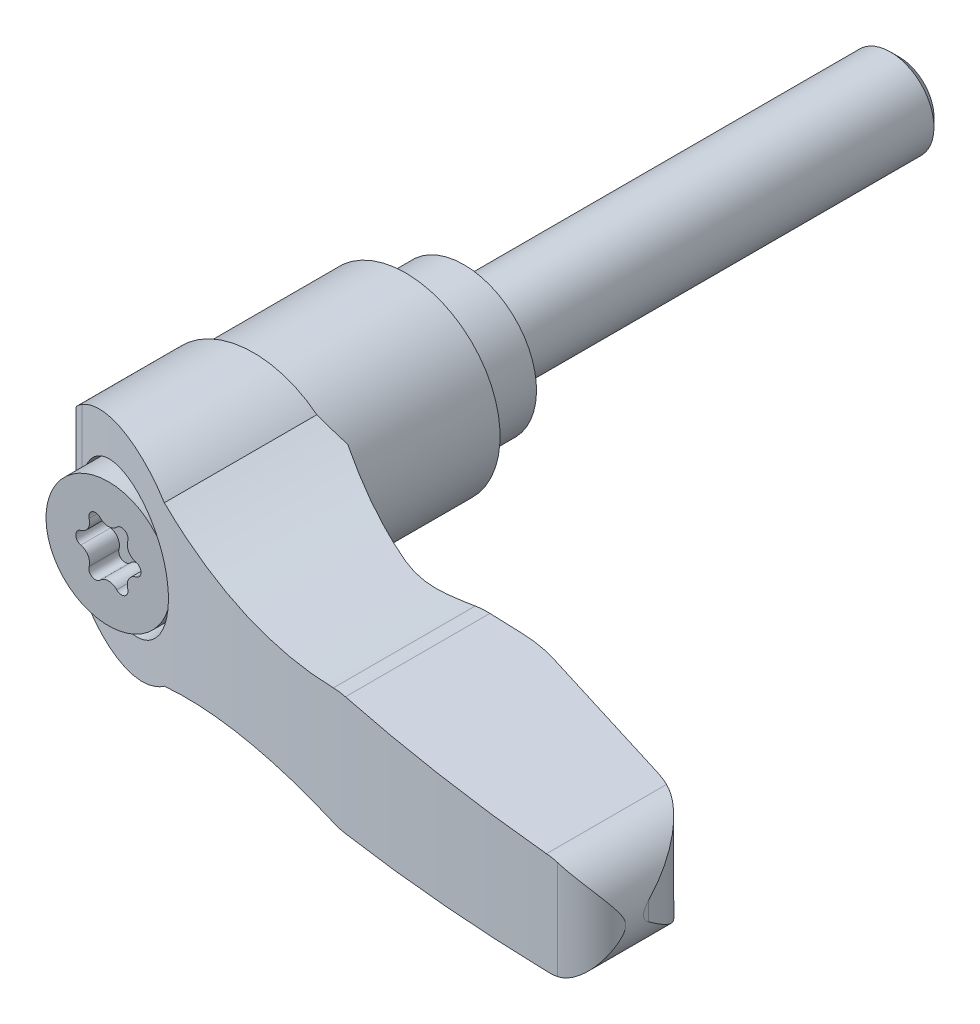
ISO-10303-21;
HEADER;
FILE_DESCRIPTION(('STEP AP214'),'2;1');
FILE_NAME('part.step','',(''),(''),'','','');
FILE_SCHEMA(('AUTOMOTIVE_DESIGN { 1 0 10303 214 1 1 1 1 }'));
ENDSEC;
DATA;
#1=APPLICATION_CONTEXT('core data for automotive mechanical design processes');
#2=APPLICATION_PROTOCOL_DEFINITION('international standard','automotive_design',2000,#1);
#3=PRODUCT_CONTEXT('',#1,'mechanical');
#4=PRODUCT('Part','Part','',(#3));
#5=PRODUCT_RELATED_PRODUCT_CATEGORY('part','',(#4));
#6=PRODUCT_DEFINITION_FORMATION('','',#4);
#7=PRODUCT_DEFINITION_CONTEXT('part definition',#1,'design');
#8=PRODUCT_DEFINITION('design','',#6,#7);
#9=PRODUCT_DEFINITION_SHAPE('','',#8);
#10=(LENGTH_UNIT() NAMED_UNIT(*) SI_UNIT(.MILLI.,.METRE.));
#11=(NAMED_UNIT(*) PLANE_ANGLE_UNIT() SI_UNIT($,.RADIAN.));
#12=(NAMED_UNIT(*) SI_UNIT($,.STERADIAN.) SOLID_ANGLE_UNIT());
#13=UNCERTAINTY_MEASURE_WITH_UNIT(LENGTH_MEASURE(1.E-05),#10,'distance_accuracy_value','');
#14=(GEOMETRIC_REPRESENTATION_CONTEXT(3) GLOBAL_UNCERTAINTY_ASSIGNED_CONTEXT((#13)) GLOBAL_UNIT_ASSIGNED_CONTEXT((#10,
#11,#12)) REPRESENTATION_CONTEXT('',''));
#15=CARTESIAN_POINT('',(0.,0.,0.));
#16=DIRECTION('',(0.,0.,1.));
#17=DIRECTION('',(1.,0.,0.));
#18=AXIS2_PLACEMENT_3D('',#15,#16,#17);
#19=CARTESIAN_POINT('',(0.,0.,-4.6928325));
#20=DIRECTION('',(0.,0.,-1.));
#21=DIRECTION('',(0.,1.,0.));
#22=AXIS2_PLACEMENT_3D('',#19,#20,#21);
#23=CYLINDRICAL_SURFACE('',#22,3.);
#24=CARTESIAN_POINT('',(0.,0.,-29.39));
#25=DIRECTION('',(0.,0.,-1.));
#26=DIRECTION('',(0.,1.,0.));
#27=AXIS2_PLACEMENT_3D('',#24,#25,#26);
#28=CIRCLE('',#27,3.);
#29=CARTESIAN_POINT('',(0.,3.,-29.39));
#30=VERTEX_POINT('',#29);
#31=EDGE_CURVE('E9',#30,#30,#28,.F.);
#32=ORIENTED_EDGE('',*,*,#31,.T.);
#33=EDGE_LOOP('',(#32));
#34=FACE_BOUND('',#33,.T.);
#35=CARTESIAN_POINT('',(0.,0.,0.));
#36=DIRECTION('',(0.,0.,-1.));
#37=DIRECTION('',(0.,1.,0.));
#38=AXIS2_PLACEMENT_3D('',#35,#36,#37);
#39=CIRCLE('',#38,3.);
#40=CARTESIAN_POINT('',(0.,3.,0.));
#41=VERTEX_POINT('',#40);
#42=EDGE_CURVE('E565',#41,#41,#39,.F.);
#43=ORIENTED_EDGE('',*,*,#42,.F.);
#44=EDGE_LOOP('',(#43));
#45=FACE_BOUND('',#44,.T.);
#46=ADVANCED_FACE('F14',(#34,#45),#23,.T.);
#47=CARTESIAN_POINT('',(4.,0.,0.));
#48=DIRECTION('',(0.,0.,-1.));
#49=DIRECTION('',(0.,1.,0.));
#50=AXIS2_PLACEMENT_3D('',#47,#48,#49);
#51=PLANE('',#50);
#52=ORIENTED_EDGE('',*,*,#42,.T.);
#53=EDGE_LOOP('',(#52));
#54=FACE_BOUND('',#53,.T.);
#55=CARTESIAN_POINT('',(0.,0.,0.));
#56=DIRECTION('',(0.,0.,-1.));
#57=DIRECTION('',(0.,1.,0.));
#58=AXIS2_PLACEMENT_3D('',#55,#56,#57);
#59=CIRCLE('',#58,5.);
#60=CARTESIAN_POINT('',(0.,5.,0.));
#61=VERTEX_POINT('',#60);
#62=EDGE_CURVE('E725',#61,#61,#59,.F.);
#63=ORIENTED_EDGE('',*,*,#62,.F.);
#64=EDGE_LOOP('',(#63));
#65=FACE_BOUND('',#64,.T.);
#66=ADVANCED_FACE('F668',(#54,#65),#51,.T.);
#67=CARTESIAN_POINT('',(0.,0.,6.4));
#68=DIRECTION('',(0.,0.,-1.));
#69=DIRECTION('',(0.,1.,0.));
#70=AXIS2_PLACEMENT_3D('',#67,#68,#69);
#71=CYLINDRICAL_SURFACE('',#70,5.);
#72=ORIENTED_EDGE('',*,*,#62,.T.);
#73=EDGE_LOOP('',(#72));
#74=FACE_BOUND('',#73,.T.);
#75=CARTESIAN_POINT('',(0.,0.,4.55000000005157));
#76=DIRECTION('',(0.,0.,-1.));
#77=DIRECTION('',(1.,0.,0.));
#78=AXIS2_PLACEMENT_3D('',#75,#76,#77);
#79=CIRCLE('',#78,4.99999999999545);
#80=CARTESIAN_POINT('',(4.99999999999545,0.,4.55000000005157));
#81=VERTEX_POINT('',#80);
#82=EDGE_CURVE('E558',#81,#81,#79,.T.);
#83=ORIENTED_EDGE('',*,*,#82,.T.);
#84=EDGE_LOOP('',(#83));
#85=FACE_BOUND('',#84,.T.);
#86=ADVANCED_FACE('F675',(#74,#85),#71,.T.);
#87=CARTESIAN_POINT('',(0.,0.,4.30000000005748));
#88=DIRECTION('',(0.,0.,-1.));
#89=DIRECTION('',(0.,1.,0.));
#90=AXIS2_PLACEMENT_3D('',#87,#88,#89);
#91=CONICAL_SURFACE('',#90,5.24999999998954,0.785398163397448);
#92=ORIENTED_EDGE('',*,*,#82,.F.);
#93=EDGE_LOOP('',(#92));
#94=FACE_BOUND('',#93,.T.);
#95=CARTESIAN_POINT('',(0.,0.,4.3));
#96=DIRECTION('',(0.,0.,-1.));
#97=DIRECTION('',(0.,1.,0.));
#98=AXIS2_PLACEMENT_3D('',#95,#96,#97);
#99=CIRCLE('',#98,5.25);
#100=CARTESIAN_POINT('',(0.,5.25,4.3));
#101=VERTEX_POINT('',#100);
#102=EDGE_CURVE('E554',#101,#101,#99,.T.);
#103=ORIENTED_EDGE('',*,*,#102,.T.);
#104=EDGE_LOOP('',(#103));
#105=FACE_BOUND('',#104,.T.);
#106=ADVANCED_FACE('F683',(#94,#105),#91,.F.);
#107=CARTESIAN_POINT('',(0.,0.,3.65));
#108=DIRECTION('',(0.,0.,-1.));
#109=DIRECTION('',(0.,1.,0.));
#110=AXIS2_PLACEMENT_3D('',#107,#108,#109);
#111=CYLINDRICAL_SURFACE('',#110,5.25);
#112=ORIENTED_EDGE('',*,*,#102,.F.);
#113=EDGE_LOOP('',(#112));
#114=FACE_BOUND('',#113,.T.);
#115=CARTESIAN_POINT('',(0.,0.,4.));
#116=DIRECTION('',(0.,0.,-1.));
#117=DIRECTION('',(0.,1.,0.));
#118=AXIS2_PLACEMENT_3D('',#115,#116,#117);
#119=CIRCLE('',#118,5.25);
#120=CARTESIAN_POINT('',(0.,5.25,4.));
#121=VERTEX_POINT('',#120);
#122=EDGE_CURVE('E713',#121,#121,#119,.F.);
#123=ORIENTED_EDGE('',*,*,#122,.F.);
#124=EDGE_LOOP('',(#123));
#125=FACE_BOUND('',#124,.T.);
#126=ADVANCED_FACE('F690',(#114,#125),#111,.F.);
#127=CARTESIAN_POINT('',(-6.36002265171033,-14.,4.));
#128=DIRECTION('',(0.707106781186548,0.,0.707106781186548));
#129=DIRECTION('',(-0.707106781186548,0.,0.707106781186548));
#130=AXIS2_PLACEMENT_3D('',#127,#128,#129);
#131=PLANE('',#130);
#132=DIRECTION('',(0.,1.,0.));
#133=VECTOR('',#132,1.);
#134=CARTESIAN_POINT('',(-6.36002265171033,0.,4.));
#135=LINE('',#134,#133);
#136=CARTESIAN_POINT('',(-6.36002265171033,-1.38824072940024,4.));
#137=VERTEX_POINT('',#136);
#138=CARTESIAN_POINT('',(-6.36002265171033,1.38824072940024,4.));
#139=VERTEX_POINT('',#138);
#140=EDGE_CURVE('E715',#137,#139,#135,.T.);
#141=ORIENTED_EDGE('',*,*,#140,.F.);
#142=CARTESIAN_POINT('',(-0.0100000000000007,0.,-2.35002265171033));
#143=DIRECTION('',(0.707106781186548,0.,0.707106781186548));
#144=DIRECTION('',(-0.707106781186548,0.,0.707106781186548));
#145=AXIS2_PLACEMENT_3D('',#142,#143,#144);
#146=ELLIPSE('',#145,9.19238815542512,6.5);
#147=EDGE_CURVE('E557',#139,#137,#146,.T.);
#148=ORIENTED_EDGE('',*,*,#147,.F.);
#149=EDGE_LOOP('',(#141,#148));
#150=FACE_BOUND('',#149,.T.);
#151=ADVANCED_FACE('F694',(#150),#131,.F.);
#152=CARTESIAN_POINT('',(-3.26,0.,4.));
#153=DIRECTION('',(0.,0.,-1.));
#154=DIRECTION('',(0.,1.,0.));
#155=AXIS2_PLACEMENT_3D('',#152,#153,#154);
#156=PLANE('',#155);
#157=CARTESIAN_POINT('',(-0.00999999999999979,0.,4.));
#158=DIRECTION('',(0.,0.,1.));
#159=DIRECTION('',(-1.,0.,0.));
#160=AXIS2_PLACEMENT_3D('',#157,#158,#159);
#161=CIRCLE('',#160,6.5);
#162=EDGE_CURVE('E709',#137,#139,#161,.T.);
#163=ORIENTED_EDGE('',*,*,#162,.F.);
#164=ORIENTED_EDGE('',*,*,#140,.T.);
#165=EDGE_LOOP('',(#163,#164));
#166=FACE_BOUND('',#165,.T.);
#167=ORIENTED_EDGE('',*,*,#122,.T.);
#168=EDGE_LOOP('',(#167));
#169=FACE_BOUND('',#168,.T.);
#170=ADVANCED_FACE('F697',(#166,#169),#156,.T.);
#171=CARTESIAN_POINT('',(39.9389658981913,-8.,27.2042491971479));
#172=DIRECTION('',(0.989626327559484,0.,-0.143665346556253));
#173=DIRECTION('',(0.143665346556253,0.,0.989626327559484));
#174=AXIS2_PLACEMENT_3D('',#171,#172,#173);
#175=PLANE('',#174);
#176=CARTESIAN_POINT('',(36.5,0.,3.51522972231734));
#177=DIRECTION('',(0.989626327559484,0.,-0.143665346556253));
#178=DIRECTION('',(0.143665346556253,0.,0.989626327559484));
#179=AXIS2_PLACEMENT_3D('',#176,#177,#178);
#180=ELLIPSE('',#179,24.3621728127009,3.5);
#181=CARTESIAN_POINT('',(39.9389658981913,-0.650779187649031,27.2042491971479));
#182=VERTEX_POINT('',#181);
#183=CARTESIAN_POINT('',(39.9389658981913,0.650779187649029,27.2042491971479));
#184=VERTEX_POINT('',#183);
#185=EDGE_CURVE('E461',#182,#184,#180,.F.);
#186=ORIENTED_EDGE('',*,*,#185,.F.);
#187=DIRECTION('',(0.,-1.,0.));
#188=VECTOR('',#187,1.);
#189=CARTESIAN_POINT('',(39.9389658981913,-8.,27.2042491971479));
#190=LINE('',#189,#188);
#191=EDGE_CURVE('E848',#184,#182,#190,.T.);
#192=ORIENTED_EDGE('',*,*,#191,.F.);
#193=EDGE_LOOP('',(#186,#192));
#194=FACE_BOUND('',#193,.T.);
#195=ADVANCED_FACE('F485',(#194),#175,.T.);
#196=CARTESIAN_POINT('',(33.8626602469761,-8.,28.0863544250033));
#197=DIRECTION('',(0.,-1.,0.));
#198=DIRECTION('',(1.,0.,0.));
#199=AXIS2_PLACEMENT_3D('',#196,#197,#198);
#200=CYLINDRICAL_SURFACE('',#199,6.14);
#201=ORIENTED_EDGE('',*,*,#191,.T.);
#202=CARTESIAN_POINT('',(36.5,-3.5,22.5416236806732));
#203=CARTESIAN_POINT('',(36.6061539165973,-3.50000941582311,22.5920863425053));
#204=CARTESIAN_POINT('',(36.7107657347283,-3.49517280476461,22.6456099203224));
#205=CARTESIAN_POINT('',(36.9160027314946,-3.47671082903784,22.758101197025));
#206=CARTESIAN_POINT('',(37.0166343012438,-3.46310021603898,22.8170596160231));
#207=CARTESIAN_POINT('',(37.2123479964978,-3.42816986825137,22.9392782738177));
#208=CARTESIAN_POINT('',(37.3074768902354,-3.40693163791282,23.002487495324));
#209=CARTESIAN_POINT('',(37.4929223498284,-3.3575759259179,23.13320682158));
#210=CARTESIAN_POINT('',(37.5832363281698,-3.32945478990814,23.2007191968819));
#211=CARTESIAN_POINT('',(37.7830795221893,-3.25850520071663,23.358740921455));
#212=CARTESIAN_POINT('',(37.8909927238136,-3.21376078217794,23.4504360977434));
#213=CARTESIAN_POINT('',(38.0982482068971,-3.11588681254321,23.6389903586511));
#214=CARTESIAN_POINT('',(38.1975840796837,-3.06275107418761,23.7358532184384));
#215=CARTESIAN_POINT('',(38.3880468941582,-2.94917464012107,23.9343090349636));
#216=CARTESIAN_POINT('',(38.4791322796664,-2.88870020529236,24.0359224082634));
#217=CARTESIAN_POINT('',(38.6526412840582,-2.76182607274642,24.2426721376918));
#218=CARTESIAN_POINT('',(38.7350674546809,-2.69542813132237,24.3478074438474));
#219=CARTESIAN_POINT('',(38.9229341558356,-2.52996933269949,24.6038856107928));
#220=CARTESIAN_POINT('',(39.0243159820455,-2.42850340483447,24.7562617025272));
#221=CARTESIAN_POINT('',(39.2111706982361,-2.21796613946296,25.0654781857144));
#222=CARTESIAN_POINT('',(39.2966363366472,-2.10889136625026,25.2223205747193));
#223=CARTESIAN_POINT('',(39.452222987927,-1.88493092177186,25.5392893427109));
#224=CARTESIAN_POINT('',(39.5223498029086,-1.77004746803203,25.699414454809));
#225=CARTESIAN_POINT('',(39.6478320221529,-1.53583460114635,26.0220530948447));
#226=CARTESIAN_POINT('',(39.7031929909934,-1.41650688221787,26.1845656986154));
#227=CARTESIAN_POINT('',(39.7933776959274,-1.1901857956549,26.4900634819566));
#228=CARTESIAN_POINT('',(39.8299343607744,-1.08360162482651,26.6328455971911));
#229=CARTESIAN_POINT('',(39.8923391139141,-0.86858691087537,26.918504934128));
#230=CARTESIAN_POINT('',(39.918226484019,-0.76016469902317,27.0613798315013));
#231=CARTESIAN_POINT('',(39.9389658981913,-0.650779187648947,27.204249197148));
#232=B_SPLINE_CURVE_WITH_KNOTS('',3,(#202,#203,#204,#205,#206,#207,#208,#209,#210,#211,#212,
#213,#214,#215,#216,#217,#218,#219,#220,#221,#222,#223,#224,#225,#226,#227,#228,#229,#230,#231),
.UNSPECIFIED.,.F.,.F.,(4,2,2,2,2,2,2,2,2,2,2,2,2,2,4),(0.,0.352350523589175,0.704110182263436,
1.05221781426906,1.40051067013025,1.84538152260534,2.29058194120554,2.73791274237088,
3.18511134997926,3.81198117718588,4.43913591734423,5.06605301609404,5.69273352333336,
6.23807905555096,6.78139842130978),.UNSPECIFIED.);
#233=CARTESIAN_POINT('',(36.5,-3.5,22.5416236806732));
#234=VERTEX_POINT('',#233);
#235=EDGE_CURVE('E465',#234,#182,#232,.T.);
#236=ORIENTED_EDGE('',*,*,#235,.F.);
#237=CARTESIAN_POINT('',(33.8626602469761,-3.59762871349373,28.0863544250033));
#238=DIRECTION('',(-0.0369925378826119,0.999315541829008,0.));
#239=DIRECTION('',(-0.999315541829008,-0.0369925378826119,0.));
#240=AXIS2_PLACEMENT_3D('',#237,#238,#239);
#241=ELLIPSE('',#240,6.14420545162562,6.14);
#242=CARTESIAN_POINT('',(35.5344609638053,-3.53574220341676,22.1783359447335));
#243=VERTEX_POINT('',#242);
#244=EDGE_CURVE('E717',#234,#243,#241,.T.);
#245=ORIENTED_EDGE('',*,*,#244,.T.);
#246=DIRECTION('',(0.,-1.,0.));
#247=VECTOR('',#246,1.);
#248=CARTESIAN_POINT('',(35.5344609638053,-8.,22.1783359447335));
#249=LINE('',#248,#247);
#250=CARTESIAN_POINT('',(35.5344609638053,3.53574220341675,22.1783359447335));
#251=VERTEX_POINT('',#250);
#252=EDGE_CURVE('E539',#251,#243,#249,.T.);
#253=ORIENTED_EDGE('',*,*,#252,.F.);
#254=CARTESIAN_POINT('',(33.8626602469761,3.59762871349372,28.0863544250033));
#255=DIRECTION('',(-0.036992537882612,-0.999315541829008,0.));
#256=DIRECTION('',(0.999315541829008,-0.036992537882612,0.));
#257=AXIS2_PLACEMENT_3D('',#254,#255,#256);
#258=ELLIPSE('',#257,6.14420545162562,6.14);
#259=CARTESIAN_POINT('',(36.5,3.5,22.5416236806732));
#260=VERTEX_POINT('',#259);
#261=EDGE_CURVE('E847',#251,#260,#258,.T.);
#262=ORIENTED_EDGE('',*,*,#261,.T.);
#263=CARTESIAN_POINT('',(39.9389658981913,0.65077918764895,27.204249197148));
#264=CARTESIAN_POINT('',(39.9247028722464,0.726086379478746,27.1059853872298));
#265=CARTESIAN_POINT('',(39.9079968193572,0.800887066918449,27.0076860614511));
#266=CARTESIAN_POINT('',(39.8696347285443,0.949458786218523,26.8112602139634));
#267=CARTESIAN_POINT('',(39.8479781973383,1.02322971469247,26.7131337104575));
#268=CARTESIAN_POINT('',(39.7995979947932,1.169880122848,26.5170899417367));
#269=CARTESIAN_POINT('',(39.7728626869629,1.24275713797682,26.4191736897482));
#270=CARTESIAN_POINT('',(39.7142815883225,1.38725410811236,26.2239599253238));
#271=CARTESIAN_POINT('',(39.6824358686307,1.4588740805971,26.1266624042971));
#272=CARTESIAN_POINT('',(39.5782917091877,1.67318502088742,25.8337016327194));
#273=CARTESIAN_POINT('',(39.4979263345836,1.81366367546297,25.6391889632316));
#274=CARTESIAN_POINT('',(39.3150854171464,2.08619457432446,25.2551202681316));
#275=CARTESIAN_POINT('',(39.2126344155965,2.218255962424,25.0655590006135));
#276=CARTESIAN_POINT('',(38.9595027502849,2.49877334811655,24.6523338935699));
#277=CARTESIAN_POINT('',(38.8031801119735,2.64456339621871,24.4302018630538));
#278=CARTESIAN_POINT('',(38.5417124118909,2.84488994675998,24.1082756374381));
#279=CARTESIAN_POINT('',(38.4501831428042,2.90854134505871,24.0029632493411));
#280=CARTESIAN_POINT('',(38.2579442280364,3.02861213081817,23.7967186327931));
#281=CARTESIAN_POINT('',(38.1572360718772,3.08503268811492,23.6957856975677));
#282=CARTESIAN_POINT('',(37.8892625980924,3.21757634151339,23.4457323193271));
#283=CARTESIAN_POINT('',(37.7155213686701,3.28779061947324,23.3001643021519));
#284=CARTESIAN_POINT('',(37.4396992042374,3.37286339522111,23.0946053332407));
#285=CARTESIAN_POINT('',(37.3453175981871,3.39783246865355,23.0282732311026));
#286=CARTESIAN_POINT('',(37.1517842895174,3.44019984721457,22.9003457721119));
#287=CARTESIAN_POINT('',(37.0526354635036,3.45760265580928,22.8387476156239));
#288=CARTESIAN_POINT('',(36.8781783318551,3.48029211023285,22.7372021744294));
#289=CARTESIAN_POINT('',(36.8038676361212,3.48759914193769,22.6959814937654));
#290=CARTESIAN_POINT('',(36.6533047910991,3.497455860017,22.6165121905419));
#291=CARTESIAN_POINT('',(36.5770513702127,3.50000234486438,22.5782655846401));
#292=CARTESIAN_POINT('',(36.5,3.5,22.5416236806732));
#293=B_SPLINE_CURVE_WITH_KNOTS('',3,(#263,#264,#265,#266,#267,#268,#269,#270,#271,#272,#273,
#274,#275,#276,#277,#278,#279,#280,#281,#282,#283,#284,#285,#286,#287,#288,#289,#290,#291,#292),
.UNSPECIFIED.,.F.,.F.,(4,2,2,2,2,2,2,2,2,2,2,2,2,2,4),(0.,0.373839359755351,0.747715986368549,
1.12245980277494,1.49719840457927,2.25512351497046,3.01221072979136,3.93367725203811,
4.39332639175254,4.85290107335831,5.56171222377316,5.91546495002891,6.26900683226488,
6.52468766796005,6.78054039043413),.UNSPECIFIED.);
#294=EDGE_CURVE('E434',#184,#260,#293,.T.);
#295=ORIENTED_EDGE('',*,*,#294,.F.);
#296=EDGE_LOOP('',(#201,#236,#245,#253,#262,#295));
#297=FACE_BOUND('',#296,.T.);
#298=ADVANCED_FACE('F479',(#297),#200,.T.);
#299=CARTESIAN_POINT('',(-0.0099999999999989,0.,10.28125));
#300=DIRECTION('',(0.,0.,1.));
#301=DIRECTION('',(-1.,0.,0.));
#302=AXIS2_PLACEMENT_3D('',#299,#300,#301);
#303=CYLINDRICAL_SURFACE('',#302,6.5);
#304=CARTESIAN_POINT('',(-0.00999999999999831,0.,14.5));
#305=DIRECTION('',(0.,0.,1.));
#306=DIRECTION('',(-1.,0.,0.));
#307=AXIS2_PLACEMENT_3D('',#304,#305,#306);
#308=CIRCLE('',#307,6.5);
#309=CARTESIAN_POINT('',(-6.51,0.,14.5));
#310=VERTEX_POINT('',#309);
#311=CARTESIAN_POINT('',(6.49,0.,14.5));
#312=VERTEX_POINT('',#311);
#313=EDGE_CURVE('E850',#310,#312,#308,.T.);
#314=ORIENTED_EDGE('',*,*,#313,.F.);
#315=CARTESIAN_POINT('',(-0.00999999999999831,0.,14.5));
#316=DIRECTION('',(0.,0.,1.));
#317=DIRECTION('',(-1.,0.,0.));
#318=AXIS2_PLACEMENT_3D('',#315,#316,#317);
#319=CIRCLE('',#318,6.5);
#320=EDGE_CURVE('E536',#312,#310,#319,.T.);
#321=ORIENTED_EDGE('',*,*,#320,.F.);
#322=EDGE_LOOP('',(#314,#321));
#323=FACE_BOUND('',#322,.T.);
#324=ORIENTED_EDGE('',*,*,#162,.T.);
#325=ORIENTED_EDGE('',*,*,#147,.T.);
#326=EDGE_LOOP('',(#324,#325));
#327=FACE_BOUND('',#326,.T.);
#328=ADVANCED_FACE('F484',(#323,#327),#303,.T.);
#329=CARTESIAN_POINT('',(-6.51,-8.,14.5));
#330=DIRECTION('',(0.,0.,-1.));
#331=DIRECTION('',(0.,1.,0.));
#332=AXIS2_PLACEMENT_3D('',#329,#330,#331);
#333=PLANE('',#332);
#334=ORIENTED_EDGE('',*,*,#313,.T.);
#335=DIRECTION('',(0.,-1.,0.));
#336=VECTOR('',#335,1.);
#337=CARTESIAN_POINT('',(6.49,-8.,14.5));
#338=LINE('',#337,#336);
#339=CARTESIAN_POINT('',(6.49,-4.77390244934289,14.5));
#340=VERTEX_POINT('',#339);
#341=EDGE_CURVE('E853',#312,#340,#338,.T.);
#342=ORIENTED_EDGE('',*,*,#341,.T.);
#343=CARTESIAN_POINT('',(14.8,-33.6,14.5));
#344=DIRECTION('',(0.,0.,1.));
#345=DIRECTION('',(0.,-1.,0.));
#346=AXIS2_PLACEMENT_3D('',#343,#344,#345);
#347=CIRCLE('',#346,30.);
#348=CARTESIAN_POINT('',(4.36278582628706,-5.47413005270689,14.5));
#349=VERTEX_POINT('',#348);
#350=EDGE_CURVE('E810',#340,#349,#347,.T.);
#351=ORIENTED_EDGE('',*,*,#350,.T.);
#352=CARTESIAN_POINT('',(0.,0.,14.5));
#353=DIRECTION('',(0.,0.,1.));
#354=DIRECTION('',(0.,-1.,0.));
#355=AXIS2_PLACEMENT_3D('',#352,#353,#354);
#356=CIRCLE('',#355,7.);
#357=CARTESIAN_POINT('',(-6.51,-2.57291663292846,14.5));
#358=VERTEX_POINT('',#357);
#359=EDGE_CURVE('E372',#358,#349,#356,.T.);
#360=ORIENTED_EDGE('',*,*,#359,.F.);
#361=DIRECTION('',(0.,-1.,0.));
#362=VECTOR('',#361,1.);
#363=CARTESIAN_POINT('',(-6.51,-8.,14.5));
#364=LINE('',#363,#362);
#365=EDGE_CURVE('E535',#310,#358,#364,.T.);
#366=ORIENTED_EDGE('',*,*,#365,.F.);
#367=EDGE_LOOP('',(#334,#342,#351,#360,#366));
#368=FACE_BOUND('',#367,.T.);
#369=ADVANCED_FACE('F490',(#368),#333,.T.);
#370=CARTESIAN_POINT('',(20.6060580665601,0.915064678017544,31.));
#371=DIRECTION('',(0.,0.,1.));
#372=DIRECTION('',(0.,-1.,0.));
#373=AXIS2_PLACEMENT_3D('',#370,#371,#372);
#374=CYLINDRICAL_SURFACE('',#373,5.);
#375=CARTESIAN_POINT('',(20.7910207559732,-4.08151303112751,28.9575923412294));
#376=CARTESIAN_POINT('',(20.6207575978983,-4.08776311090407,28.9275070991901));
#377=CARTESIAN_POINT('',(20.4510927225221,-4.08540030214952,28.8972050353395));
#378=CARTESIAN_POINT('',(20.1129595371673,-4.06344890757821,28.8361672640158));
#379=CARTESIAN_POINT('',(19.9444912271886,-4.04386032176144,28.8054315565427));
#380=CARTESIAN_POINT('',(19.7766211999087,-4.01565884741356,28.7744790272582));
#381=B_SPLINE_CURVE_WITH_KNOTS('',3,(#375,#376,#377,#378,#379,#380),.UNSPECIFIED.,.F.,.F.,(4,2,
4),(0.,0.517097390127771,1.03419478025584),.UNSPECIFIED.);
#382=CARTESIAN_POINT('',(20.7910207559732,-4.08151303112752,28.9575923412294));
#383=VERTEX_POINT('',#382);
#384=CARTESIAN_POINT('',(19.7766211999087,-4.01565884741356,28.7744790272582));
#385=VERTEX_POINT('',#384);
#386=EDGE_CURVE('E468',#383,#385,#381,.T.);
#387=ORIENTED_EDGE('',*,*,#386,.T.);
#388=DIRECTION('',(0.,0.,1.));
#389=VECTOR('',#388,1.);
#390=CARTESIAN_POINT('',(19.7766211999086,-4.01565884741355,31.));
#391=LINE('',#390,#389);
#392=CARTESIAN_POINT('',(19.7766211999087,-4.01565884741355,19.));
#393=VERTEX_POINT('',#392);
#394=EDGE_CURVE('E803',#385,#393,#391,.F.);
#395=ORIENTED_EDGE('',*,*,#394,.T.);
#396=CARTESIAN_POINT('',(20.6060580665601,0.915064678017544,19.));
#397=DIRECTION('',(0.,0.,1.));
#398=DIRECTION('',(0.,-1.,0.));
#399=AXIS2_PLACEMENT_3D('',#396,#397,#398);
#400=CIRCLE('',#399,5.);
#401=CARTESIAN_POINT('',(20.7910207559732,-4.08151303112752,19.));
#402=VERTEX_POINT('',#401);
#403=EDGE_CURVE('E857',#402,#393,#400,.F.);
#404=ORIENTED_EDGE('',*,*,#403,.F.);
#405=DIRECTION('',(0.,0.,1.));
#406=VECTOR('',#405,1.);
#407=CARTESIAN_POINT('',(20.7910207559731,-4.08151303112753,31.));
#408=LINE('',#407,#406);
#409=EDGE_CURVE('E809',#402,#383,#408,.T.);
#410=ORIENTED_EDGE('',*,*,#409,.T.);
#411=EDGE_LOOP('',(#387,#395,#404,#410));
#412=FACE_BOUND('',#411,.T.);
#413=ADVANCED_FACE('F426',(#412),#374,.T.);
#414=CARTESIAN_POINT('',(36.5,0.,31.));
#415=DIRECTION('',(0.,0.,1.));
#416=DIRECTION('',(0.,-1.,0.));
#417=AXIS2_PLACEMENT_3D('',#414,#415,#416);
#418=CYLINDRICAL_SURFACE('',#417,3.5);
#419=CARTESIAN_POINT('',(37.3240183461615,-3.40161634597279,30.8631619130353));
#420=CARTESIAN_POINT('',(37.188603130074,-3.43435641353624,30.8557619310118));
#421=CARTESIAN_POINT('',(37.0522273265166,-3.45892508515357,30.8481012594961));
#422=CARTESIAN_POINT('',(36.7775545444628,-3.49171963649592,30.8322585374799));
#423=CARTESIAN_POINT('',(36.6392575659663,-3.499945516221,30.8240764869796));
#424=CARTESIAN_POINT('',(36.5,-3.5,30.815633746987));
#425=B_SPLINE_CURVE_WITH_KNOTS('',3,(#419,#420,#421,#422,#423,#424),.UNSPECIFIED.,.F.,.F.,(4,2,
4),(0.,0.416348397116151,0.832696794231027),.UNSPECIFIED.);
#426=CARTESIAN_POINT('',(37.3240183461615,-3.40161634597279,30.8631619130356));
#427=VERTEX_POINT('',#426);
#428=CARTESIAN_POINT('',(36.5,-3.5,30.815633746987));
#429=VERTEX_POINT('',#428);
#430=EDGE_CURVE('E446',#427,#429,#425,.T.);
#431=ORIENTED_EDGE('',*,*,#430,.T.);
#432=DIRECTION('',(0.,0.,1.));
#433=VECTOR('',#432,1.);
#434=CARTESIAN_POINT('',(36.5,-3.5,31.));
#435=LINE('',#434,#433);
#436=EDGE_CURVE('E820',#429,#234,#435,.F.);
#437=ORIENTED_EDGE('',*,*,#436,.T.);
#438=ORIENTED_EDGE('',*,*,#235,.T.);
#439=ORIENTED_EDGE('',*,*,#185,.T.);
#440=ORIENTED_EDGE('',*,*,#294,.T.);
#441=DIRECTION('',(0.,0.,1.));
#442=VECTOR('',#441,1.);
#443=CARTESIAN_POINT('',(36.5,3.5,31.));
#444=LINE('',#443,#442);
#445=CARTESIAN_POINT('',(36.5,3.5,30.815633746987));
#446=VERTEX_POINT('',#445);
#447=EDGE_CURVE('E414',#260,#446,#444,.T.);
#448=ORIENTED_EDGE('',*,*,#447,.T.);
#449=CARTESIAN_POINT('',(36.5,3.5,30.815633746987));
#450=CARTESIAN_POINT('',(36.6392575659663,3.499945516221,30.8240764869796));
#451=CARTESIAN_POINT('',(36.7775545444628,3.49171963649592,30.8322585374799));
#452=CARTESIAN_POINT('',(37.0522273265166,3.45892508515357,30.8481012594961));
#453=CARTESIAN_POINT('',(37.188603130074,3.43435641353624,30.8557619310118));
#454=CARTESIAN_POINT('',(37.3240183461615,3.40161634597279,30.8631619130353));
#455=B_SPLINE_CURVE_WITH_KNOTS('',3,(#449,#450,#451,#452,#453,#454),.UNSPECIFIED.,.F.,.F.,(4,2,
4),(0.,0.416348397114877,0.832696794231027),.UNSPECIFIED.);
#456=CARTESIAN_POINT('',(37.3240183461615,3.40161634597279,30.8631619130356));
#457=VERTEX_POINT('',#456);
#458=EDGE_CURVE('E452',#446,#457,#455,.T.);
#459=ORIENTED_EDGE('',*,*,#458,.T.);
#460=CARTESIAN_POINT('',(37.3240183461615,-3.40161634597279,30.8631619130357));
#461=CARTESIAN_POINT('',(37.391971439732,-3.38517327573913,30.8668921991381));
#462=CARTESIAN_POINT('',(37.4595366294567,-3.36663320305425,30.8678982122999));
#463=CARTESIAN_POINT('',(37.5932555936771,-3.32560440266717,30.8647814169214));
#464=CARTESIAN_POINT('',(37.6594109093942,-3.30312026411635,30.8606645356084));
#465=CARTESIAN_POINT('',(37.7892420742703,-3.25463078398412,30.8476880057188));
#466=CARTESIAN_POINT('',(37.8529349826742,-3.22865926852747,30.8388717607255));
#467=CARTESIAN_POINT('',(37.9780608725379,-3.17332967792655,30.8169101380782));
#468=CARTESIAN_POINT('',(38.0394932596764,-3.14397072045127,30.8037636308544));
#469=CARTESIAN_POINT('',(38.2193405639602,-3.05154774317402,30.7585650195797));
#470=CARTESIAN_POINT('',(38.3339861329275,-2.98387991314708,30.7206782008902));
#471=CARTESIAN_POINT('',(38.5517467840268,-2.83858348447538,30.6324207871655));
#472=CARTESIAN_POINT('',(38.6548343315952,-2.76093200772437,30.5820212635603));
#473=CARTESIAN_POINT('',(38.8266237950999,-2.61655584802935,30.4842690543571));
#474=CARTESIAN_POINT('',(38.8977926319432,-2.55140368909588,30.4388637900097));
#475=CARTESIAN_POINT('',(39.0330318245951,-2.41719472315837,30.3433991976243));
#476=CARTESIAN_POINT('',(39.0970985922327,-2.34813596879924,30.2933375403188));
#477=CARTESIAN_POINT('',(39.2184581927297,-2.20651617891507,30.1893556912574));
#478=CARTESIAN_POINT('',(39.2757265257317,-2.13394372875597,30.1354226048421));
#479=CARTESIAN_POINT('',(39.3834200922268,-1.9860149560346,30.0247265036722));
#480=CARTESIAN_POINT('',(39.4338475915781,-1.91065956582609,29.9679644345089));
#481=CARTESIAN_POINT('',(39.542421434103,-1.73419420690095,29.8348143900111));
#482=CARTESIAN_POINT('',(39.598263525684,-1.63221056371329,29.7576996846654));
#483=CARTESIAN_POINT('',(39.699250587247,-1.42414609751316,29.601672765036));
#484=CARTESIAN_POINT('',(39.7443776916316,-1.31805876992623,29.5227577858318));
#485=CARTESIAN_POINT('',(39.8239747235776,-1.10201279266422,29.3659397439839));
#486=CARTESIAN_POINT('',(39.8584944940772,-0.992075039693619,29.2880336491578));
#487=CARTESIAN_POINT('',(39.9024720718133,-0.82253324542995,29.1754655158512));
#488=CARTESIAN_POINT('',(39.9158188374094,-0.765322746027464,29.13870216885));
#489=CARTESIAN_POINT('',(39.9398686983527,-0.648731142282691,29.0678855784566));
#490=CARTESIAN_POINT('',(39.9505741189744,-0.589352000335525,29.0338299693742));
#491=CARTESIAN_POINT('',(39.9677206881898,-0.477086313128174,28.9756719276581));
#492=CARTESIAN_POINT('',(39.974567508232,-0.424644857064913,28.9508463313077));
#493=CARTESIAN_POINT('',(39.9860225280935,-0.317100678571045,28.907341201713));
#494=CARTESIAN_POINT('',(39.9906385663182,-0.262008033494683,28.8886402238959));
#495=CARTESIAN_POINT('',(39.9966232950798,-0.160247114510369,28.8637621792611));
#496=CARTESIAN_POINT('',(39.9984523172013,-0.114054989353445,28.8558445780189));
#497=CARTESIAN_POINT('',(40.0002450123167,-0.0209847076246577,28.8480882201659));
#498=CARTESIAN_POINT('',(40.0002117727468,0.0258921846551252,28.8482360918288));
#499=CARTESIAN_POINT('',(39.9982952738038,0.118672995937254,28.8565205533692));
#500=CARTESIAN_POINT('',(39.9964185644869,0.164579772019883,28.8646288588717));
#501=CARTESIAN_POINT('',(39.9910078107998,0.254792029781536,28.8870889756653));
#502=CARTESIAN_POINT('',(39.9874686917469,0.299092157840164,28.9014598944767));
#503=CARTESIAN_POINT('',(39.9768286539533,0.407331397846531,28.9425912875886));
#504=CARTESIAN_POINT('',(39.9688318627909,0.470155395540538,28.9719647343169));
#505=CARTESIAN_POINT('',(39.9499914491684,0.592804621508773,29.0357410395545));
#506=CARTESIAN_POINT('',(39.9391403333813,0.652621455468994,29.0701570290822));
#507=CARTESIAN_POINT('',(39.9146680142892,0.770512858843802,29.1419527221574));
#508=CARTESIAN_POINT('',(39.9010255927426,0.828569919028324,29.1793537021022));
#509=CARTESIAN_POINT('',(39.8711029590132,0.942947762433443,29.2555520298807));
#510=CARTESIAN_POINT('',(39.8548256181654,0.999270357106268,29.2943478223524));
#511=CARTESIAN_POINT('',(39.8016739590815,1.1674299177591,29.4125134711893));
#512=CARTESIAN_POINT('',(39.7607265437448,1.27728939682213,29.4929030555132));
#513=CARTESIAN_POINT('',(39.6677865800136,1.49294867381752,29.6529500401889));
#514=CARTESIAN_POINT('',(39.6157834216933,1.59874445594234,29.7326066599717));
#515=CARTESIAN_POINT('',(39.5005966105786,1.80564912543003,29.8886982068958));
#516=CARTESIAN_POINT('',(39.4374685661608,1.90677830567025,29.9651469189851));
#517=CARTESIAN_POINT('',(39.2994325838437,2.10420227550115,30.1133265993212));
#518=CARTESIAN_POINT('',(39.2245348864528,2.20050117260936,30.1850615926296));
#519=CARTESIAN_POINT('',(39.0442952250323,2.40820732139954,30.3372677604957));
#520=CARTESIAN_POINT('',(38.9358891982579,2.51819093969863,30.4161164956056));
#521=CARTESIAN_POINT('',(38.7000552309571,2.72661786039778,30.559662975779));
#522=CARTESIAN_POINT('',(38.5726400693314,2.82506883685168,30.6243701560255));
#523=CARTESIAN_POINT('',(38.3254291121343,2.98922527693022,30.7237895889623));
#524=CARTESIAN_POINT('',(38.2087731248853,3.05759969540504,30.7618633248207));
#525=CARTESIAN_POINT('',(37.9650872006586,3.18151973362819,30.8217517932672));
#526=CARTESIAN_POINT('',(37.8380870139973,3.23710049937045,30.8436114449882));
#527=CARTESIAN_POINT('',(37.6449762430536,3.3080955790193,30.8616374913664));
#528=CARTESIAN_POINT('',(37.5816159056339,3.32934954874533,30.8652564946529));
#529=CARTESIAN_POINT('',(37.4536360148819,3.36824327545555,30.867801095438));
#530=CARTESIAN_POINT('',(37.389015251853,3.38587935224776,30.8667219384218));
#531=CARTESIAN_POINT('',(37.3240183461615,3.40161634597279,30.8631619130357));
#532=B_SPLINE_CURVE_WITH_KNOTS('',3,(#460,#461,#462,#463,#464,#465,#466,#467,#468,#469,#470,
#471,#472,#473,#474,#475,#476,#477,#478,#479,#480,#481,#482,#483,#484,#485,#486,#487,#488,#489,
#490,#491,#492,#493,#494,#495,#496,#497,#498,#499,#500,#501,#502,#503,#504,#505,#506,#507,#508,
#509,#510,#511,#512,#513,#514,#515,#516,#517,#518,#519,#520,#521,#522,#523,#524,#525,#526,#527,
#528,#529,#530,#531),.UNSPECIFIED.,.F.,.F.,(4,2,2,2,2,2,2,2,2,2,2,2,2,2,2,2,2,2,2,2,2,2,2,2,2,2,
2,2,2,2,2,2,2,2,2,4),(0.,0.20991378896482,0.419584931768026,0.62735226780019,0.83517384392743,
1.2486492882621,1.66308971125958,1.98257890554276,2.30222878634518,2.62299771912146,
2.94366014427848,3.36167065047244,3.78037330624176,4.19707731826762,4.40489951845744,
4.61253810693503,4.78756393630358,4.9619702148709,5.10204921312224,5.24189598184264,
5.38124764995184,5.52102749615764,5.72989301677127,5.9393124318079,6.15038720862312,
6.36123350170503,6.7871576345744,7.21349237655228,7.63775356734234,8.06164764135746,
8.58013018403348,9.09826573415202,9.51811060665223,9.9367879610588,10.1373304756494,
10.3380759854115),.UNSPECIFIED.);
#533=EDGE_CURVE('E406',#427,#457,#532,.T.);
#534=ORIENTED_EDGE('',*,*,#533,.F.);
#535=EDGE_LOOP('',(#431,#437,#438,#439,#440,#448,#459,#534));
#536=FACE_BOUND('',#535,.T.);
#537=ADVANCED_FACE('F420',(#536),#418,.T.);
#538=CARTESIAN_POINT('',(23.0466685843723,-8.,28.05));
#539=DIRECTION('',(0.,-1.,0.));
#540=DIRECTION('',(1.,0.,0.));
#541=AXIS2_PLACEMENT_3D('',#538,#539,#540);
#542=CYLINDRICAL_SURFACE('',#541,9.05000000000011);
#543=CARTESIAN_POINT('',(23.0466685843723,3.99801374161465,28.05));
#544=DIRECTION('',(-0.036992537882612,-0.999315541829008,0.));
#545=DIRECTION('',(0.999315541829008,-0.036992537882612,0.));
#546=AXIS2_PLACEMENT_3D('',#543,#544,#545);
#547=ELLIPSE('',#546,9.05619858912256,9.05000000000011);
#548=CARTESIAN_POINT('',(23.0466685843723,3.99801374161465,19.));
#549=VERTEX_POINT('',#548);
#550=CARTESIAN_POINT('',(25.5108048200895,3.90679665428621,19.34192715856));
#551=VERTEX_POINT('',#550);
#552=EDGE_CURVE('E402',#549,#551,#547,.T.);
#553=ORIENTED_EDGE('',*,*,#552,.T.);
#554=DIRECTION('',(0.,-1.,0.));
#555=VECTOR('',#554,1.);
#556=CARTESIAN_POINT('',(25.5108048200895,-8.,19.34192715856));
#557=LINE('',#556,#555);
#558=CARTESIAN_POINT('',(25.5108048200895,-3.90679665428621,19.34192715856));
#559=VERTEX_POINT('',#558);
#560=EDGE_CURVE('E459',#559,#551,#557,.F.);
#561=ORIENTED_EDGE('',*,*,#560,.F.);
#562=CARTESIAN_POINT('',(23.0466685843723,-3.99801374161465,28.05));
#563=DIRECTION('',(-0.0369925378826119,0.999315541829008,0.));
#564=DIRECTION('',(-0.999315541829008,-0.0369925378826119,0.));
#565=AXIS2_PLACEMENT_3D('',#562,#563,#564);
#566=ELLIPSE('',#565,9.05619858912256,9.05000000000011);
#567=CARTESIAN_POINT('',(23.0466685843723,-3.99801374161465,19.));
#568=VERTEX_POINT('',#567);
#569=EDGE_CURVE('E416',#559,#568,#566,.T.);
#570=ORIENTED_EDGE('',*,*,#569,.T.);
#571=DIRECTION('',(0.,1.,0.));
#572=VECTOR('',#571,1.);
#573=CARTESIAN_POINT('',(23.0466685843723,-8.,19.));
#574=LINE('',#573,#572);
#575=EDGE_CURVE('E543',#549,#568,#574,.F.);
#576=ORIENTED_EDGE('',*,*,#575,.F.);
#577=EDGE_LOOP('',(#553,#561,#570,#576));
#578=FACE_BOUND('',#577,.T.);
#579=ADVANCED_FACE('F425',(#578),#542,.T.);
#580=CARTESIAN_POINT('',(25.5108048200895,-8.,19.34192715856));
#581=DIRECTION('',(0.272280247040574,0.,-0.962217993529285));
#582=DIRECTION('',(0.962217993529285,0.,0.272280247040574));
#583=AXIS2_PLACEMENT_3D('',#580,#581,#582);
#584=PLANE('',#583);
#585=DIRECTION('',(0.961608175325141,-0.0355966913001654,0.272107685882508));
#586=VECTOR('',#585,1.);
#587=CARTESIAN_POINT('',(25.5108048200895,3.90679665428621,19.34192715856));
#588=LINE('',#587,#586);
#589=EDGE_CURVE('E404',#551,#251,#588,.T.);
#590=ORIENTED_EDGE('',*,*,#589,.T.);
#591=ORIENTED_EDGE('',*,*,#252,.T.);
#592=DIRECTION('',(-0.961608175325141,-0.0355966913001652,-0.272107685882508));
#593=VECTOR('',#592,1.);
#594=CARTESIAN_POINT('',(35.5344609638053,-3.53574220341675,22.1783359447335));
#595=LINE('',#594,#593);
#596=EDGE_CURVE('E817',#243,#559,#595,.T.);
#597=ORIENTED_EDGE('',*,*,#596,.T.);
#598=ORIENTED_EDGE('',*,*,#560,.T.);
#599=EDGE_LOOP('',(#590,#591,#597,#598));
#600=FACE_BOUND('',#599,.T.);
#601=ADVANCED_FACE('F875',(#600),#584,.T.);
#602=CARTESIAN_POINT('',(20.60605806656,-0.915064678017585,31.));
#603=DIRECTION('',(0.,0.,1.));
#604=DIRECTION('',(0.,-1.,0.));
#605=AXIS2_PLACEMENT_3D('',#602,#603,#604);
#606=CYLINDRICAL_SURFACE('',#605,5.00000000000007);
#607=CARTESIAN_POINT('',(19.7766211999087,4.01565884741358,28.7744790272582));
#608=CARTESIAN_POINT('',(19.9444912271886,4.04386032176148,28.8054315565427));
#609=CARTESIAN_POINT('',(20.1129595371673,4.06344890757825,28.8361672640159));
#610=CARTESIAN_POINT('',(20.4510927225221,4.08540030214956,28.8972050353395));
#611=CARTESIAN_POINT('',(20.6207575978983,4.08776311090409,28.9275070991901));
#612=CARTESIAN_POINT('',(20.7910207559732,4.08151303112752,28.9575923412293));
#613=B_SPLINE_CURVE_WITH_KNOTS('',3,(#607,#608,#609,#610,#611,#612),.UNSPECIFIED.,.F.,.F.,(4,2,
4),(0.,0.517097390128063,1.03419478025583),.UNSPECIFIED.);
#614=CARTESIAN_POINT('',(19.7766211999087,4.01565884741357,28.7744790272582));
#615=VERTEX_POINT('',#614);
#616=CARTESIAN_POINT('',(20.7910207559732,4.08151303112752,28.9575923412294));
#617=VERTEX_POINT('',#616);
#618=EDGE_CURVE('E542',#615,#617,#613,.T.);
#619=ORIENTED_EDGE('',*,*,#618,.T.);
#620=DIRECTION('',(0.,0.,1.));
#621=VECTOR('',#620,1.);
#622=CARTESIAN_POINT('',(20.7910207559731,4.08151303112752,31.));
#623=LINE('',#622,#621);
#624=CARTESIAN_POINT('',(20.7910207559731,4.08151303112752,19.));
#625=VERTEX_POINT('',#624);
#626=EDGE_CURVE('E828',#617,#625,#623,.F.);
#627=ORIENTED_EDGE('',*,*,#626,.T.);
#628=CARTESIAN_POINT('',(20.60605806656,-0.915064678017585,19.));
#629=DIRECTION('',(0.,0.,1.));
#630=DIRECTION('',(0.,-1.,0.));
#631=AXIS2_PLACEMENT_3D('',#628,#629,#630);
#632=CIRCLE('',#631,5.00000000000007);
#633=CARTESIAN_POINT('',(19.7766211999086,4.01565884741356,19.));
#634=VERTEX_POINT('',#633);
#635=EDGE_CURVE('E547',#634,#625,#632,.F.);
#636=ORIENTED_EDGE('',*,*,#635,.F.);
#637=DIRECTION('',(0.,0.,1.));
#638=VECTOR('',#637,1.);
#639=CARTESIAN_POINT('',(19.7766211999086,4.01565884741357,31.));
#640=LINE('',#639,#638);
#641=EDGE_CURVE('E401',#634,#615,#640,.T.);
#642=ORIENTED_EDGE('',*,*,#641,.T.);
#643=EDGE_LOOP('',(#619,#627,#636,#642));
#644=FACE_BOUND('',#643,.T.);
#645=ADVANCED_FACE('F872',(#644),#606,.T.);
#646=CARTESIAN_POINT('',(42.8289340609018,-8.,-49.9630271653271));
#647=DIRECTION('',(0.,-1.,0.));
#648=DIRECTION('',(1.,0.,0.));
#649=AXIS2_PLACEMENT_3D('',#646,#647,#648);
#650=CYLINDRICAL_SURFACE('',#649,74.0000000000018);
#651=DIRECTION('',(0.,-1.,0.));
#652=VECTOR('',#651,1.);
#653=CARTESIAN_POINT('',(14.2560355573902,-8.,18.2981585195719));
#654=LINE('',#653,#652);
#655=CARTESIAN_POINT('',(14.2560355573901,3.60493202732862,18.2981585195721));
#656=VERTEX_POINT('',#655);
#657=CARTESIAN_POINT('',(14.2560355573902,-3.60493202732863,18.2981585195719));
#658=VERTEX_POINT('',#657);
#659=EDGE_CURVE('E855',#656,#658,#654,.T.);
#660=ORIENTED_EDGE('',*,*,#659,.T.);
#661=CARTESIAN_POINT('',(14.2560355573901,-3.60493202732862,18.2981585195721));
#662=CARTESIAN_POINT('',(13.91912090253,-3.61104217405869,18.1571345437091));
#663=CARTESIAN_POINT('',(13.5833701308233,-3.62280963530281,18.0136612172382));
#664=CARTESIAN_POINT('',(12.9145226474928,-3.65743626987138,17.7219861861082));
#665=CARTESIAN_POINT('',(12.5814258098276,-3.68029491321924,17.5737847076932));
#666=CARTESIAN_POINT('',(11.5893580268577,-3.7649360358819,17.1235938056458));
#667=CARTESIAN_POINT('',(10.9347595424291,-3.84283944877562,16.8148240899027));
#668=CARTESIAN_POINT('',(9.64003521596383,-4.03983028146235,16.1808788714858));
#669=CARTESIAN_POINT('',(8.99990836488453,-4.15891482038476,15.8557045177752));
#670=CARTESIAN_POINT('',(7.73340291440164,-4.43691869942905,15.1892512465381));
#671=CARTESIAN_POINT('',(7.10709183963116,-4.5960001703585,14.8479114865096));
#672=CARTESIAN_POINT('',(6.49,-4.77390244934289,14.5));
#673=B_SPLINE_CURVE_WITH_KNOTS('',3,(#661,#662,#663,#664,#665,#666,#667,#668,#669,#670,#671,
#672),.UNSPECIFIED.,.F.,.F.,(4,2,2,2,2,4),(0.,1.09575278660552,2.19145321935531,
4.37360080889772,6.55559577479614,8.74658240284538),.UNSPECIFIED.);
#674=EDGE_CURVE('E356',#658,#340,#673,.T.);
#675=ORIENTED_EDGE('',*,*,#674,.T.);
#676=ORIENTED_EDGE('',*,*,#341,.F.);
#677=DIRECTION('',(0.,1.,0.));
#678=VECTOR('',#677,1.);
#679=CARTESIAN_POINT('',(6.49,-8.,14.5));
#680=LINE('',#679,#678);
#681=CARTESIAN_POINT('',(6.49,4.77390244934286,14.5));
#682=VERTEX_POINT('',#681);
#683=EDGE_CURVE('E546',#682,#312,#680,.F.);
#684=ORIENTED_EDGE('',*,*,#683,.F.);
#685=CARTESIAN_POINT('',(6.49,4.77390244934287,14.5));
#686=CARTESIAN_POINT('',(7.10709183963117,4.59600017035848,14.8479114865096));
#687=CARTESIAN_POINT('',(7.73340291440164,4.43691869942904,15.1892512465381));
#688=CARTESIAN_POINT('',(8.99990836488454,4.15891482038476,15.8557045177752));
#689=CARTESIAN_POINT('',(9.64003521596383,4.03983028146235,16.1808788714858));
#690=CARTESIAN_POINT('',(10.9347595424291,3.84283944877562,16.8148240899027));
#691=CARTESIAN_POINT('',(11.5893580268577,3.7649360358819,17.1235938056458));
#692=CARTESIAN_POINT('',(12.5814258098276,3.68029491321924,17.5737847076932));
#693=CARTESIAN_POINT('',(12.9145226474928,3.65743626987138,17.7219861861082));
#694=CARTESIAN_POINT('',(13.5833701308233,3.62280963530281,18.0136612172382));
#695=CARTESIAN_POINT('',(13.91912090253,3.61104217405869,18.1571345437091));
#696=CARTESIAN_POINT('',(14.2560355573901,3.60493202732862,18.2981585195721));
#697=B_SPLINE_CURVE_WITH_KNOTS('',3,(#685,#686,#687,#688,#689,#690,#691,#692,#693,#694,#695,
#696),.UNSPECIFIED.,.F.,.F.,(4,2,2,2,2,4),(0.,2.19098662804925,4.37298159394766,
6.55512918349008,7.65082961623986,8.74658240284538),.UNSPECIFIED.);
#698=EDGE_CURVE('E392',#682,#656,#697,.T.);
#699=ORIENTED_EDGE('',*,*,#698,.T.);
#700=EDGE_LOOP('',(#660,#675,#676,#684,#699));
#701=FACE_BOUND('',#700,.T.);
#702=ADVANCED_FACE('F379',(#701),#650,.F.);
#703=CARTESIAN_POINT('',(17.7504238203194,-8.,9.95000000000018));
#704=DIRECTION('',(0.,-1.,0.));
#705=DIRECTION('',(1.,0.,0.));
#706=AXIS2_PLACEMENT_3D('',#703,#704,#705);
#707=CYLINDRICAL_SURFACE('',#706,9.04999999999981);
#708=ORIENTED_EDGE('',*,*,#659,.F.);
#709=CARTESIAN_POINT('',(14.2560355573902,3.60493202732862,18.2981585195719));
#710=CARTESIAN_POINT('',(14.483816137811,3.60077563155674,18.3935396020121));
#711=CARTESIAN_POINT('',(14.7155749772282,3.59919241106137,18.4795580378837));
#712=CARTESIAN_POINT('',(15.1854578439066,3.60156277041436,18.6324166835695));
#713=CARTESIAN_POINT('',(15.4235855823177,3.60551965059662,18.699245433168));
#714=CARTESIAN_POINT('',(15.9002362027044,3.61924836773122,18.8121846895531));
#715=CARTESIAN_POINT('',(16.1386829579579,3.62891979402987,18.8586293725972));
#716=CARTESIAN_POINT('',(16.6180975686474,3.65418161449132,18.9321530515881));
#717=CARTESIAN_POINT('',(16.8590635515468,3.66976787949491,18.9592455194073));
#718=CARTESIAN_POINT('',(17.2084780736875,3.69663888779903,18.9844088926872));
#719=CARTESIAN_POINT('',(17.3166030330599,3.70554405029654,18.9902441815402));
#720=CARTESIAN_POINT('',(17.5333084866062,3.72457700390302,18.9980471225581));
#721=CARTESIAN_POINT('',(17.641889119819,3.73470940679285,18.9999996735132));
#722=CARTESIAN_POINT('',(17.7504238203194,3.74543587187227,19.));
#723=B_SPLINE_CURVE_WITH_KNOTS('',3,(#709,#710,#711,#712,#713,#714,#715,#716,#717,#718,#719,
#720,#721,#722),.UNSPECIFIED.,.F.,.F.,(4,2,2,2,2,2,4),(0.,0.740736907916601,1.48191527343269,
2.2104421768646,2.93846142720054,3.26434207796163,3.59148772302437),.UNSPECIFIED.);
#724=CARTESIAN_POINT('',(17.7504238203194,3.74543587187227,19.));
#725=VERTEX_POINT('',#724);
#726=EDGE_CURVE('E385',#656,#725,#723,.T.);
#727=ORIENTED_EDGE('',*,*,#726,.T.);
#728=DIRECTION('',(0.,1.,0.));
#729=VECTOR('',#728,1.);
#730=CARTESIAN_POINT('',(17.7504238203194,-8.,19.));
#731=LINE('',#730,#729);
#732=CARTESIAN_POINT('',(17.7504238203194,-3.74543587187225,19.));
#733=VERTEX_POINT('',#732);
#734=EDGE_CURVE('E858',#733,#725,#731,.T.);
#735=ORIENTED_EDGE('',*,*,#734,.F.);
#736=CARTESIAN_POINT('',(17.7504238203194,-3.74543587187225,19.));
#737=CARTESIAN_POINT('',(17.5046390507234,-3.72111558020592,19.0000347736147));
#738=CARTESIAN_POINT('',(17.2585407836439,-3.69988852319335,18.9899888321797));
#739=CARTESIAN_POINT('',(16.7673975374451,-3.66357523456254,18.9498183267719));
#740=CARTESIAN_POINT('',(16.5223532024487,-3.64849234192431,18.9196828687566));
#741=CARTESIAN_POINT('',(16.039413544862,-3.6246526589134,18.8400993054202));
#742=CARTESIAN_POINT('',(15.8014675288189,-3.61579257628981,18.7909886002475));
#743=CARTESIAN_POINT('',(15.3302904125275,-3.60376296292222,18.6737788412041));
#744=CARTESIAN_POINT('',(15.0970562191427,-3.60058957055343,18.605692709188));
#745=CARTESIAN_POINT('',(14.7640124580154,-3.59984438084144,18.4937500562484));
#746=CARTESIAN_POINT('',(14.6616681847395,-3.60014663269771,18.4572847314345));
#747=CARTESIAN_POINT('',(14.4579719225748,-3.60177627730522,18.3805483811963));
#748=CARTESIAN_POINT('',(14.3566253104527,-3.60310763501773,18.3402631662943));
#749=CARTESIAN_POINT('',(14.2560355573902,-3.60493202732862,18.2981585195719));
#750=B_SPLINE_CURVE_WITH_KNOTS('',3,(#736,#737,#738,#739,#740,#741,#742,#743,#744,#745,#746,
#747,#748,#749),.UNSPECIFIED.,.F.,.F.,(4,2,2,2,2,2,4),(0.,0.740745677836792,1.48189337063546,
2.21042785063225,2.93846742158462,3.26434594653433,3.59148632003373),.UNSPECIFIED.);
#751=EDGE_CURVE('E364',#733,#658,#750,.T.);
#752=ORIENTED_EDGE('',*,*,#751,.T.);
#753=EDGE_LOOP('',(#708,#727,#735,#752));
#754=FACE_BOUND('',#753,.T.);
#755=ADVANCED_FACE('F374',(#754),#707,.F.);
#756=CARTESIAN_POINT('',(17.7504238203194,-8.,19.));
#757=DIRECTION('',(0.,0.,-1.));
#758=DIRECTION('',(0.,1.,0.));
#759=AXIS2_PLACEMENT_3D('',#756,#757,#758);
#760=PLANE('',#759);
#761=DIRECTION('',(0.999315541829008,-0.036992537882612,0.));
#762=VECTOR('',#761,1.);
#763=CARTESIAN_POINT('',(20.7910207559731,4.08151303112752,19.));
#764=LINE('',#763,#762);
#765=EDGE_CURVE('E405',#625,#549,#764,.T.);
#766=ORIENTED_EDGE('',*,*,#765,.T.);
#767=ORIENTED_EDGE('',*,*,#575,.T.);
#768=DIRECTION('',(-0.999315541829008,-0.0369925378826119,0.));
#769=VECTOR('',#768,1.);
#770=CARTESIAN_POINT('',(36.5,-3.5,19.));
#771=LINE('',#770,#769);
#772=EDGE_CURVE('E415',#568,#402,#771,.T.);
#773=ORIENTED_EDGE('',*,*,#772,.T.);
#774=ORIENTED_EDGE('',*,*,#403,.T.);
#775=CARTESIAN_POINT('',(14.8,-33.6,19.));
#776=DIRECTION('',(0.,0.,1.));
#777=DIRECTION('',(0.,-1.,0.));
#778=AXIS2_PLACEMENT_3D('',#775,#776,#777);
#779=CIRCLE('',#778,30.);
#780=EDGE_CURVE('E806',#393,#733,#779,.T.);
#781=ORIENTED_EDGE('',*,*,#780,.T.);
#782=ORIENTED_EDGE('',*,*,#734,.T.);
#783=CARTESIAN_POINT('',(14.8,33.6,19.));
#784=DIRECTION('',(0.,0.,1.));
#785=DIRECTION('',(0.,-1.,0.));
#786=AXIS2_PLACEMENT_3D('',#783,#784,#785);
#787=CIRCLE('',#786,30.);
#788=EDGE_CURVE('E391',#725,#634,#787,.T.);
#789=ORIENTED_EDGE('',*,*,#788,.T.);
#790=ORIENTED_EDGE('',*,*,#635,.T.);
#791=EDGE_LOOP('',(#766,#767,#773,#774,#781,#782,#789,#790));
#792=FACE_BOUND('',#791,.T.);
#793=ADVANCED_FACE('F378',(#792),#760,.T.);
#794=CARTESIAN_POINT('',(-6.51,-8.,14.5));
#795=DIRECTION('',(0.,0.,-1.));
#796=DIRECTION('',(0.,1.,0.));
#797=AXIS2_PLACEMENT_3D('',#794,#795,#796);
#798=PLANE('',#797);
#799=DIRECTION('',(0.,-1.,0.));
#800=VECTOR('',#799,1.);
#801=CARTESIAN_POINT('',(-6.51,-8.,14.5));
#802=LINE('',#801,#800);
#803=CARTESIAN_POINT('',(-6.51,2.57291663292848,14.5));
#804=VERTEX_POINT('',#803);
#805=EDGE_CURVE('E532',#804,#310,#802,.T.);
#806=ORIENTED_EDGE('',*,*,#805,.F.);
#807=CARTESIAN_POINT('',(0.,0.,14.5));
#808=DIRECTION('',(0.,0.,1.));
#809=DIRECTION('',(0.,-1.,0.));
#810=AXIS2_PLACEMENT_3D('',#807,#808,#809);
#811=CIRCLE('',#810,7.);
#812=CARTESIAN_POINT('',(4.36278582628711,5.47413005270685,14.5));
#813=VERTEX_POINT('',#812);
#814=EDGE_CURVE('E310',#813,#804,#811,.T.);
#815=ORIENTED_EDGE('',*,*,#814,.F.);
#816=CARTESIAN_POINT('',(14.8,33.6,14.5));
#817=DIRECTION('',(0.,0.,1.));
#818=DIRECTION('',(0.,-1.,0.));
#819=AXIS2_PLACEMENT_3D('',#816,#817,#818);
#820=CIRCLE('',#819,30.);
#821=EDGE_CURVE('E398',#813,#682,#820,.T.);
#822=ORIENTED_EDGE('',*,*,#821,.T.);
#823=ORIENTED_EDGE('',*,*,#683,.T.);
#824=ORIENTED_EDGE('',*,*,#320,.T.);
#825=EDGE_LOOP('',(#806,#815,#822,#823,#824));
#826=FACE_BOUND('',#825,.T.);
#827=ADVANCED_FACE('F928',(#826),#798,.T.);
#828=CARTESIAN_POINT('',(-6.51,-8.,18.7873257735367));
#829=DIRECTION('',(-1.,0.,0.));
#830=DIRECTION('',(0.,-1.,0.));
#831=AXIS2_PLACEMENT_3D('',#828,#829,#830);
#832=PLANE('',#831);
#833=ORIENTED_EDGE('',*,*,#805,.T.);
#834=ORIENTED_EDGE('',*,*,#365,.T.);
#835=DIRECTION('',(0.,0.,1.));
#836=VECTOR('',#835,1.);
#837=CARTESIAN_POINT('',(-6.51,-2.57291663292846,31.));
#838=LINE('',#837,#836);
#839=CARTESIAN_POINT('',(-6.51,-2.57291663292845,18.7873257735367));
#840=VERTEX_POINT('',#839);
#841=EDGE_CURVE('E551',#840,#358,#838,.F.);
#842=ORIENTED_EDGE('',*,*,#841,.F.);
#843=DIRECTION('',(0.,-1.,0.));
#844=VECTOR('',#843,1.);
#845=CARTESIAN_POINT('',(-6.51,-8.,18.7873257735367));
#846=LINE('',#845,#844);
#847=CARTESIAN_POINT('',(-6.51,2.57291663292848,18.7873257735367));
#848=VERTEX_POINT('',#847);
#849=EDGE_CURVE('E293',#848,#840,#846,.T.);
#850=ORIENTED_EDGE('',*,*,#849,.F.);
#851=DIRECTION('',(0.,0.,1.));
#852=VECTOR('',#851,1.);
#853=CARTESIAN_POINT('',(-6.51,2.57291663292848,31.));
#854=LINE('',#853,#852);
#855=EDGE_CURVE('E517',#804,#848,#854,.T.);
#856=ORIENTED_EDGE('',*,*,#855,.F.);
#857=EDGE_LOOP('',(#833,#834,#842,#850,#856));
#858=FACE_BOUND('',#857,.T.);
#859=ADVANCED_FACE('F317',(#858),#832,.T.);
#860=CARTESIAN_POINT('',(0.,0.,25.1538693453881));
#861=DIRECTION('',(0.,0.,1.));
#862=DIRECTION('',(0.,-1.,0.));
#863=AXIS2_PLACEMENT_3D('',#860,#861,#862);
#864=CONICAL_SURFACE('',#863,4.7682842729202,0.122173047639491);
#865=CARTESIAN_POINT('',(0.,0.,21.3400000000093));
#866=DIRECTION('',(0.,0.,1.));
#867=DIRECTION('',(1.,0.,0.));
#868=AXIS2_PLACEMENT_3D('',#865,#866,#867);
#869=CIRCLE('',#868,4.30000000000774);
#870=CARTESIAN_POINT('',(4.30000000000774,0.,21.3400000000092));
#871=VERTEX_POINT('',#870);
#872=EDGE_CURVE('E548',#871,#871,#869,.T.);
#873=ORIENTED_EDGE('',*,*,#872,.F.);
#874=EDGE_LOOP('',(#873));
#875=FACE_BOUND('',#874,.T.);
#876=CARTESIAN_POINT('',(-4.25177912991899,-1.08631234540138,22.0596314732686));
#877=CARTESIAN_POINT('',(-4.27354601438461,-0.997032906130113,22.0513567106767));
#878=CARTESIAN_POINT('',(-4.29261458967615,-0.907015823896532,22.0438858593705));
#879=CARTESIAN_POINT('',(-4.32530565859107,-0.725854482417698,22.0308280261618));
#880=CARTESIAN_POINT('',(-4.33892760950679,-0.63471011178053,22.0252412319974));
#881=CARTESIAN_POINT('',(-4.36049527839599,-0.453144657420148,22.0163024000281));
#882=CARTESIAN_POINT('',(-4.36852947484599,-0.362735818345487,22.0129155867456));
#883=CARTESIAN_POINT('',(-4.37924475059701,-0.181551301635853,22.0083822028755));
#884=CARTESIAN_POINT('',(-4.38192621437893,-0.0907756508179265,22.0072354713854));
#885=CARTESIAN_POINT('',(-4.38192621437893,0.090775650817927,22.0072354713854));
#886=CARTESIAN_POINT('',(-4.37924475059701,0.181551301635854,22.0083822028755));
#887=CARTESIAN_POINT('',(-4.36852947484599,0.362735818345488,22.0129155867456));
#888=CARTESIAN_POINT('',(-4.36049527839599,0.453144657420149,22.0163024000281));
#889=CARTESIAN_POINT('',(-4.33892760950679,0.634710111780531,22.0252412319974));
#890=CARTESIAN_POINT('',(-4.32530565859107,0.725854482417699,22.0308280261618));
#891=CARTESIAN_POINT('',(-4.29261458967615,0.907015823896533,22.0438858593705));
#892=CARTESIAN_POINT('',(-4.27354601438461,0.997032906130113,22.0513567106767));
#893=CARTESIAN_POINT('',(-4.25177912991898,1.08631234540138,22.0596314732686));
#894=B_SPLINE_CURVE_WITH_KNOTS('',3,(#876,#877,#878,#879,#880,#881,#882,#883,#884,#885,#886,
#887,#888,#889,#890,#891,#892,#893),.UNSPECIFIED.,.F.,.F.,(4,2,2,2,2,2,2,2,4),(0.,
0.276761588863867,0.553550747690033,0.825850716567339,1.09813112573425,1.37041153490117,
1.64271150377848,1.91950066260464,2.19626225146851),.UNSPECIFIED.);
#895=CARTESIAN_POINT('',(-4.25177912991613,-1.086312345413,22.0596314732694));
#896=VERTEX_POINT('',#895);
#897=CARTESIAN_POINT('',(-4.25177912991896,1.08631234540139,22.0596314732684));
#898=VERTEX_POINT('',#897);
#899=EDGE_CURVE('E294',#896,#898,#894,.T.);
#900=ORIENTED_EDGE('',*,*,#899,.F.);
#901=CARTESIAN_POINT('',(-4.25177912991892,1.08631234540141,22.0596314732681));
#902=CARTESIAN_POINT('',(-4.22199646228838,1.20855652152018,22.0709324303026));
#903=CARTESIAN_POINT('',(-4.18719545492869,1.32938768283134,22.0841280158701));
#904=CARTESIAN_POINT('',(-4.10798326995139,1.56735714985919,22.1141152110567));
#905=CARTESIAN_POINT('',(-4.06357518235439,1.68449662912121,22.1309056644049));
#906=CARTESIAN_POINT('',(-3.96569989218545,1.91395740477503,22.167842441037));
#907=CARTESIAN_POINT('',(-3.91225973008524,2.02629186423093,22.187978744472));
#908=CARTESIAN_POINT('',(-3.79672443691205,2.24577986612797,22.2314174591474));
#909=CARTESIAN_POINT('',(-3.73462881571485,2.35293311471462,22.2547200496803));
#910=CARTESIAN_POINT('',(-3.60239071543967,2.56128064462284,22.3042221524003));
#911=CARTESIAN_POINT('',(-3.53225712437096,2.6624813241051,22.3304184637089));
#912=CARTESIAN_POINT('',(-3.38446588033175,2.8584798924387,22.385470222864));
#913=CARTESIAN_POINT('',(-3.30680551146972,2.95327544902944,22.4143266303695));
#914=CARTESIAN_POINT('',(-3.06339067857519,3.2272694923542,22.5045006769));
#915=CARTESIAN_POINT('',(-2.88714625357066,3.39616336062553,22.5694442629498));
#916=CARTESIAN_POINT('',(-2.50277763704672,3.71021711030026,22.7100690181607));
#917=CARTESIAN_POINT('',(-2.29351267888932,3.8538034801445,22.7861209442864));
#918=CARTESIAN_POINT('',(-1.85578853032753,4.10388729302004,22.9438881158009));
#919=CARTESIAN_POINT('',(-1.62732427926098,4.21037491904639,23.0256048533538));
#920=CARTESIAN_POINT('',(-1.14412980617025,4.38903483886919,23.1969092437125));
#921=CARTESIAN_POINT('',(-0.888645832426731,4.45898801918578,23.2866823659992));
#922=CARTESIAN_POINT('',(-0.369631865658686,4.55382149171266,23.4672799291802));
#923=CARTESIAN_POINT('',(-0.106100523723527,4.57869418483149,23.5581045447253));
#924=CARTESIAN_POINT('',(0.293228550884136,4.58171305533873,23.6943750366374));
#925=CARTESIAN_POINT('',(0.428889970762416,4.57668818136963,23.7404326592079));
#926=CARTESIAN_POINT('',(0.699453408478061,4.5545551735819,23.8318246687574));
#927=CARTESIAN_POINT('',(0.834355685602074,4.53745145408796,23.8771593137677));
#928=CARTESIAN_POINT('',(1.10248090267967,4.49119450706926,23.9668095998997));
#929=CARTESIAN_POINT('',(1.23570309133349,4.46203607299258,24.0111247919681));
#930=CARTESIAN_POINT('',(1.49936545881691,4.39179958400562,24.0983932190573));
#931=CARTESIAN_POINT('',(1.62980675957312,4.35072643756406,24.1413470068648));
#932=CARTESIAN_POINT('',(1.8857307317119,4.25728856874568,24.2252114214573));
#933=CARTESIAN_POINT('',(2.01124861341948,4.20503421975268,24.2661375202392));
#934=CARTESIAN_POINT('',(2.25756719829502,4.08929902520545,24.3460760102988));
#935=CARTESIAN_POINT('',(2.3783698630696,4.02582291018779,24.3850891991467));
#936=CARTESIAN_POINT('',(2.61434231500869,3.88796576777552,24.4609544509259));
#937=CARTESIAN_POINT('',(2.72951082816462,3.81358228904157,24.4978060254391));
#938=CARTESIAN_POINT('',(2.95314413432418,3.65440278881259,24.5690593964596));
#939=CARTESIAN_POINT('',(3.06161191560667,3.56961145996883,24.6034622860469));
#940=CARTESIAN_POINT('',(3.2669476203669,3.39354947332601,24.6683295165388));
#941=CARTESIAN_POINT('',(3.36409951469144,3.30264671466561,24.6988937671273));
#942=CARTESIAN_POINT('',(3.55046204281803,3.11231434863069,24.7573159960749));
#943=CARTESIAN_POINT('',(3.63967621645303,3.01288858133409,24.7851751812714));
#944=CARTESIAN_POINT('',(3.80945016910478,2.80609741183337,24.8380204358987));
#945=CARTESIAN_POINT('',(3.89000530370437,2.698727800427,24.8630049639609));
#946=CARTESIAN_POINT('',(4.04161828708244,2.47691376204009,24.909894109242));
#947=CARTESIAN_POINT('',(4.11268036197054,2.36247251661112,24.9318000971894));
#948=CARTESIAN_POINT('',(4.24165433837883,2.13269083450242,24.9714605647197));
#949=CARTESIAN_POINT('',(4.30001745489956,2.01762823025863,24.9893585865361));
#950=CARTESIAN_POINT('',(4.40694877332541,1.78267645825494,25.022086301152));
#951=CARTESIAN_POINT('',(4.4555212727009,1.66278943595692,25.0369173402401));
#952=CARTESIAN_POINT('',(4.54239016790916,1.41919394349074,25.0634003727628));
#953=CARTESIAN_POINT('',(4.58070057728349,1.29549094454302,25.0750567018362));
#954=CARTESIAN_POINT('',(4.64675787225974,1.0450880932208,25.0951325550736));
#955=CARTESIAN_POINT('',(4.67450871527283,0.918389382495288,25.1035532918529));
#956=CARTESIAN_POINT('',(4.71965602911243,0.660319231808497,25.1172433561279));
#957=CARTESIAN_POINT('',(4.73682991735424,0.528905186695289,25.1224449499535));
#958=CARTESIAN_POINT('',(4.75974736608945,0.264992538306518,25.1293845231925));
#959=CARTESIAN_POINT('',(4.7654910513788,0.132493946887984,25.1311225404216));
#960=CARTESIAN_POINT('',(4.7654915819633,-0.124432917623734,25.1311226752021));
#961=CARTESIAN_POINT('',(4.760426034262,-0.248861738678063,25.1295898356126));
#962=CARTESIAN_POINT('',(4.74020654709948,-0.496864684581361,25.1234675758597));
#963=CARTESIAN_POINT('',(4.72504925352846,-0.620438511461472,25.118877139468));
#964=CARTESIAN_POINT('',(4.6847554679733,-0.86593741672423,25.1066614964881));
#965=CARTESIAN_POINT('',(4.65960781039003,-0.987860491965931,25.0990328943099));
#966=CARTESIAN_POINT('',(4.59954545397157,-1.22909585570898,25.0807868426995));
#967=CARTESIAN_POINT('',(4.5646271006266,-1.3484071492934,25.0701682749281));
#968=CARTESIAN_POINT('',(4.48540259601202,-1.58333220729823,25.0460327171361));
#969=CARTESIAN_POINT('',(4.44111301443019,-1.69895208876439,25.032520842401));
#970=CARTESIAN_POINT('',(4.34347120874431,-1.92596966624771,25.0026675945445));
#971=CARTESIAN_POINT('',(4.2901156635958,-2.0373657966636,24.9863251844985));
#972=CARTESIAN_POINT('',(4.17483704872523,-2.25508665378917,24.950927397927));
#973=CARTESIAN_POINT('',(4.11291953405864,-2.36141460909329,24.931873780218));
#974=CARTESIAN_POINT('',(3.98097349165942,-2.56843763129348,24.8911556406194));
#975=CARTESIAN_POINT('',(3.91094192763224,-2.66913056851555,24.8694901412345));
#976=CARTESIAN_POINT('',(3.76204783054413,-2.86592987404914,24.8232830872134));
#977=CARTESIAN_POINT('',(3.68305288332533,-2.96192600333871,24.7986980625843));
#978=CARTESIAN_POINT('',(3.51787983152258,-3.14684771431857,24.7471150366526));
#979=CARTESIAN_POINT('',(3.43169911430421,-3.23577070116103,24.7201161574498));
#980=CARTESIAN_POINT('',(3.16338308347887,-3.49108535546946,24.6357452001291));
#981=CARTESIAN_POINT('',(2.97134943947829,-3.64618627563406,24.5749603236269));
#982=CARTESIAN_POINT('',(2.55881446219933,-3.92802744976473,24.4432704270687));
#983=CARTESIAN_POINT('',(2.33748996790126,-4.05341061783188,24.372061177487));
#984=CARTESIAN_POINT('',(1.87896442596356,-4.26532299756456,24.2231535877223));
#985=CARTESIAN_POINT('',(1.64175984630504,-4.3518435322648,24.1454538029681));
#986=CARTESIAN_POINT('',(1.14696353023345,-4.48753194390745,23.9818173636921));
#987=CARTESIAN_POINT('',(0.888934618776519,-4.53484818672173,23.8956675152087));
#988=CARTESIAN_POINT('',(0.3695269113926,-4.58481694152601,23.7205059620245));
#989=CARTESIAN_POINT('',(0.108147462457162,-4.58746061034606,23.6314936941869));
#990=CARTESIAN_POINT('',(-0.419900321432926,-4.54765007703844,23.4499092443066));
#991=CARTESIAN_POINT('',(-0.686446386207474,-4.50365971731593,23.3573189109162));
#992=CARTESIAN_POINT('',(-1.20850703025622,-4.36915651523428,23.174233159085));
#993=CARTESIAN_POINT('',(-1.46402038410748,-4.27863851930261,23.0837379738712));
#994=CARTESIAN_POINT('',(-1.83375892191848,-4.10936093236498,22.9516437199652));
#995=CARTESIAN_POINT('',(-1.95508850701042,-4.04711736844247,22.9080970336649));
#996=CARTESIAN_POINT('',(-2.19212332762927,-3.91176676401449,22.8226650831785));
#997=CARTESIAN_POINT('',(-2.30783084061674,-3.8386641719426,22.780779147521));
#998=CARTESIAN_POINT('',(-2.53275711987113,-3.68196081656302,22.6990347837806));
#999=CARTESIAN_POINT('',(-2.64197247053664,-3.59835459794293,22.6591774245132));
#1000=CARTESIAN_POINT('',(-2.85288371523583,-3.42120534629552,22.5819253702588));
#1001=CARTESIAN_POINT('',(-2.95458302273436,-3.32766687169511,22.5445295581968));
#1002=CARTESIAN_POINT('',(-3.14637214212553,-3.13445678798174,22.4737713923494));
#1003=CARTESIAN_POINT('',(-3.23673427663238,-3.03508933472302,22.4403166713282));
#1004=CARTESIAN_POINT('',(-3.40876015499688,-2.82825837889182,22.3764422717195));
#1005=CARTESIAN_POINT('',(-3.4904279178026,-2.72079865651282,22.3460211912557));
#1006=CARTESIAN_POINT('',(-3.64423988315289,-2.49859055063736,22.2885797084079));
#1007=CARTESIAN_POINT('',(-3.71639454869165,-2.38385038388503,22.2615555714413));
#1008=CARTESIAN_POINT('',(-3.85052207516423,-2.14785568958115,22.2112104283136));
#1009=CARTESIAN_POINT('',(-3.91249913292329,-2.02660387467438,22.1878878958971));
#1010=CARTESIAN_POINT('',(-4.02864443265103,-1.77185148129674,22.1441029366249));
#1011=CARTESIAN_POINT('',(-4.08222079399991,-1.63804248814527,22.1238590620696));
#1012=CARTESIAN_POINT('',(-4.17666562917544,-1.36554805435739,22.0881201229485));
#1013=CARTESIAN_POINT('',(-4.21754606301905,-1.22686734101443,22.0726205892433));
#1014=CARTESIAN_POINT('',(-4.25177912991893,-1.0863123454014,22.0596314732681));
#1015=B_SPLINE_CURVE_WITH_KNOTS('',3,(#901,#902,#903,#904,#905,#906,#907,#908,#909,#910,#911,
#912,#913,#914,#915,#916,#917,#918,#919,#920,#921,#922,#923,#924,#925,#926,#927,#928,#929,#930,
#931,#932,#933,#934,#935,#936,#937,#938,#939,#940,#941,#942,#943,#944,#945,#946,#947,#948,#949,
#950,#951,#952,#953,#954,#955,#956,#957,#958,#959,#960,#961,#962,#963,#964,#965,#966,#967,#968,
#969,#970,#971,#972,#973,#974,#975,#976,#977,#978,#979,#980,#981,#982,#983,#984,#985,#986,#987,
#988,#989,#990,#991,#992,#993,#994,#995,#996,#997,#998,#999,#1000,#1001,#1002,#1003,#1004,#1005,
#1006,#1007,#1008,#1009,#1010,#1011,#1012,#1013,#1014),.UNSPECIFIED.,.F.,.F.,(4,2,2,2,2,2,2,2,2,
2,2,2,2,2,2,2,2,2,2,2,2,2,2,2,2,2,2,2,2,2,2,2,2,2,2,2,2,2,2,2,2,2,2,2,2,2,2,2,2,2,2,2,2,2,2,2,
4),(0.,0.378837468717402,0.75755326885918,1.13515471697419,1.51277755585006,1.88998679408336,
2.26733265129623,3.0217084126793,3.81314276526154,4.60478638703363,5.4401362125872,
6.27562683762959,6.70526560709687,7.13474744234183,7.56441496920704,7.99390573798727,
8.41933781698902,8.8445909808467,9.26993986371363,9.69509766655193,10.104124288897,
10.5129675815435,10.9220290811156,11.3309078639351,11.7211827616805,12.1112859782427,
12.5008537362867,12.8902753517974,13.2876345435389,13.6849893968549,14.0581688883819,
14.4314724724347,14.8051944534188,15.1790564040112,15.5522627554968,15.9256061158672,
16.2987083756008,16.6719507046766,17.0516850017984,17.4315579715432,18.1906840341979,
18.9796991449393,19.7688903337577,20.5935174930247,21.418307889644,22.2711370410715,
23.1240606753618,23.5530682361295,23.9819005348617,24.4109564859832,24.8398163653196,
25.2545273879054,25.6690458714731,26.0831045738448,26.4969921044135,26.9329283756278,
27.3684527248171),.UNSPECIFIED.);
#1016=EDGE_CURVE('E323',#898,#896,#1015,.T.);
#1017=ORIENTED_EDGE('',*,*,#1016,.F.);
#1018=EDGE_LOOP('',(#900,#1017));
#1019=FACE_BOUND('',#1018,.T.);
#1020=ADVANCED_FACE('F312',(#875,#1019),#864,.F.);
#1021=CARTESIAN_POINT('',(0.,0.,31.));
#1022=DIRECTION('',(0.,0.,1.));
#1023=DIRECTION('',(0.,-1.,0.));
#1024=AXIS2_PLACEMENT_3D('',#1021,#1022,#1023);
#1025=CYLINDRICAL_SURFACE('',#1024,7.);
#1026=CARTESIAN_POINT('',(-4.25177912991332,-5.56078899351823,22.0596314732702));
#1027=CARTESIAN_POINT('',(-4.08629796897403,-5.68733421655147,22.1224320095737));
#1028=CARTESIAN_POINT('',(-3.91556174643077,-5.80615587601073,22.1868570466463));
#1029=CARTESIAN_POINT('',(-3.56498217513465,-6.02775567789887,22.3183127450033));
#1030=CARTESIAN_POINT('',(-3.38514091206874,-6.13053747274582,22.3853428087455));
#1031=CARTESIAN_POINT('',(-3.01786128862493,-6.31942489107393,22.5213263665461));
#1032=CARTESIAN_POINT('',(-2.83043070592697,-6.40554708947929,22.5902778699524));
#1033=CARTESIAN_POINT('',(-2.44915025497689,-6.56079491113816,22.729574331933));
#1034=CARTESIAN_POINT('',(-2.25530009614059,-6.62991976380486,22.7999193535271));
#1035=CARTESIAN_POINT('',(-1.86267987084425,-6.75074692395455,22.94137658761));
#1036=CARTESIAN_POINT('',(-1.66391322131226,-6.8024609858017,23.0124882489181));
#1037=CARTESIAN_POINT('',(-1.2626300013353,-6.88824187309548,23.154999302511));
#1038=CARTESIAN_POINT('',(-1.06011217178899,-6.9223026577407,23.2263987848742));
#1039=CARTESIAN_POINT('',(-0.652761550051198,-6.97251881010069,23.3689368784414));
#1040=CARTESIAN_POINT('',(-0.447928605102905,-6.98867298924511,23.4400754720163));
#1041=CARTESIAN_POINT('',(-0.0373692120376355,-7.00291326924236,23.5815779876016));
#1042=CARTESIAN_POINT('',(0.168357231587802,-7.00099946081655,23.6519419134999));
#1043=CARTESIAN_POINT('',(0.582266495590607,-6.97886366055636,23.7924240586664));
#1044=CARTESIAN_POINT('',(0.790441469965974,-6.958375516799,23.8625237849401));
#1045=CARTESIAN_POINT('',(1.20462866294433,-6.89874161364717,24.0009088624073));
#1046=CARTESIAN_POINT('',(1.41064162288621,-6.8596024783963,24.0691948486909));
#1047=CARTESIAN_POINT('',(1.81893080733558,-6.76280046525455,24.2034814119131));
#1048=CARTESIAN_POINT('',(2.02120879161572,-6.70514655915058,24.26948307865));
#1049=CARTESIAN_POINT('',(2.42044538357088,-6.57158904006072,24.3987595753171));
#1050=CARTESIAN_POINT('',(2.61740519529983,-6.49568959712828,24.4620350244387));
#1051=CARTESIAN_POINT('',(3.08667265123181,-6.28990532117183,24.611668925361));
#1052=CARTESIAN_POINT('',(3.35553206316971,-6.150774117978,24.6964434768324));
#1053=CARTESIAN_POINT('',(3.74460721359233,-5.91615721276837,24.8179054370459));
#1054=CARTESIAN_POINT('',(3.8719305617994,-5.83363106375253,24.8574429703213));
#1055=CARTESIAN_POINT('',(4.12138625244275,-5.66014491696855,24.9345280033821));
#1056=CARTESIAN_POINT('',(4.24351698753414,-5.56918233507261,24.9720748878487));
#1057=CARTESIAN_POINT('',(4.36278582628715,-5.47413005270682,25.0085693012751));
#1058=B_SPLINE_CURVE_WITH_KNOTS('',3,(#1026,#1027,#1028,#1029,#1030,#1031,#1032,#1033,#1034,
#1035,#1036,#1037,#1038,#1039,#1040,#1041,#1042,#1043,#1044,#1045,#1046,#1047,#1048,#1049,#1050,
#1051,#1052,#1053,#1054,#1055,#1056,#1057),.UNSPECIFIED.,.F.,.F.,(4,2,2,2,2,2,2,2,2,2,2,2,2,2,2,
4),(0.,0.652501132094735,1.30485346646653,1.9565533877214,2.60828284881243,3.25957142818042,
3.91108272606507,4.56263726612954,5.21418853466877,5.87522605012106,6.53602896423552,
7.19651215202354,7.85684452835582,8.79706464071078,9.26717959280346,9.73743902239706),.UNSPECIFIED.);
#1059=CARTESIAN_POINT('',(-4.25177912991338,-5.56078899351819,22.0596314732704));
#1060=VERTEX_POINT('',#1059);
#1061=CARTESIAN_POINT('',(4.36278582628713,-5.47413005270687,25.0085693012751));
#1062=VERTEX_POINT('',#1061);
#1063=EDGE_CURVE('E331',#1060,#1062,#1058,.T.);
#1064=ORIENTED_EDGE('',*,*,#1063,.F.);
#1065=CARTESIAN_POINT('',(-6.51,-2.57291663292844,18.7873257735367));
#1066=CARTESIAN_POINT('',(-6.51000774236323,-2.57288663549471,18.831882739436));
#1067=CARTESIAN_POINT('',(-6.50914870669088,-2.57507123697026,18.8764033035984));
#1068=CARTESIAN_POINT('',(-6.50577146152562,-2.58359651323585,18.9648789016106));
#1069=CARTESIAN_POINT('',(-6.50325716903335,-2.58992737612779,19.0088350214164));
#1070=CARTESIAN_POINT('',(-6.49346271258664,-2.61443129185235,19.1377705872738));
#1071=CARTESIAN_POINT('',(-6.48392459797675,-2.63813776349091,19.2215473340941));
#1072=CARTESIAN_POINT('',(-6.45484049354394,-2.70868266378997,19.4169823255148));
#1073=CARTESIAN_POINT('',(-6.43280601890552,-2.76100071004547,19.5261948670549));
#1074=CARTESIAN_POINT('',(-6.38075735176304,-2.87926474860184,19.7359099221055));
#1075=CARTESIAN_POINT('',(-6.35066559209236,-2.94534174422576,19.8363144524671));
#1076=CARTESIAN_POINT('',(-6.28297159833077,-3.08717156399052,20.0317646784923));
#1077=CARTESIAN_POINT('',(-6.24518388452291,-3.16314225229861,20.1265839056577));
#1078=CARTESIAN_POINT('',(-6.16330931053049,-3.31985833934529,20.3093880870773));
#1079=CARTESIAN_POINT('',(-6.11921611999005,-3.40060848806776,20.3973660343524));
#1080=CARTESIAN_POINT('',(-6.02508684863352,-3.56472749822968,20.567405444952));
#1081=CARTESIAN_POINT('',(-5.9750527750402,-3.6480954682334,20.6494688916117));
#1082=CARTESIAN_POINT('',(-5.86914477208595,-3.81615161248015,20.8083157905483));
#1083=CARTESIAN_POINT('',(-5.81326992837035,-3.90083999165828,20.8850984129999));
#1084=CARTESIAN_POINT('',(-5.68768832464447,-4.08215174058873,21.0437767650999));
#1085=CARTESIAN_POINT('',(-5.61713431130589,-4.1788284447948,21.1249428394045));
#1086=CARTESIAN_POINT('',(-5.46845489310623,-4.37159329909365,21.2808375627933));
#1087=CARTESIAN_POINT('',(-5.39032788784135,-4.46768132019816,21.3555648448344));
#1088=CARTESIAN_POINT('',(-5.226648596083,-4.65809593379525,21.4980835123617));
#1089=CARTESIAN_POINT('',(-5.14111718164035,-4.75242662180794,21.5658932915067));
#1090=CARTESIAN_POINT('',(-4.96240674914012,-4.93874483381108,21.6942514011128));
#1091=CARTESIAN_POINT('',(-4.86922745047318,-5.03073227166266,21.7547994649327));
#1092=CARTESIAN_POINT('',(-4.6425055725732,-5.24199335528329,21.8869122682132));
#1093=CARTESIAN_POINT('',(-4.50592298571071,-5.36004629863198,21.9553396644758));
#1094=CARTESIAN_POINT('',(-4.32620960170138,-5.50328218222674,22.0306515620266));
#1095=CARTESIAN_POINT('',(-4.28920538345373,-5.53217513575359,22.0454281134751));
#1096=CARTESIAN_POINT('',(-4.25177912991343,-5.56078899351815,22.0596314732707));
#1097=B_SPLINE_CURVE_WITH_KNOTS('',3,(#1065,#1066,#1067,#1068,#1069,#1070,#1071,#1072,#1073,
#1074,#1075,#1076,#1077,#1078,#1079,#1080,#1081,#1082,#1083,#1084,#1085,#1086,#1087,#1088,#1089,
#1090,#1091,#1092,#1093,#1094,#1095,#1096),.UNSPECIFIED.,.F.,.F.,(4,2,2,2,2,2,2,2,2,2,2,2,2,2,2,
4),(0.,0.133546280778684,0.266777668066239,0.528141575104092,0.895333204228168,1.26619545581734,
1.64736416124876,2.02891826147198,2.41034381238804,2.79182916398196,3.22531405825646,
3.65889076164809,4.09128276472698,4.52369063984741,5.10143581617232,5.24906860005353),.UNSPECIFIED.);
#1098=EDGE_CURVE('E295',#840,#1060,#1097,.T.);
#1099=ORIENTED_EDGE('',*,*,#1098,.F.);
#1100=ORIENTED_EDGE('',*,*,#841,.T.);
#1101=ORIENTED_EDGE('',*,*,#359,.T.);
#1102=DIRECTION('',(0.,0.,1.));
#1103=VECTOR('',#1102,1.);
#1104=CARTESIAN_POINT('',(4.36278582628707,-5.47413005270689,31.));
#1105=LINE('',#1104,#1103);
#1106=EDGE_CURVE('E795',#349,#1062,#1105,.T.);
#1107=ORIENTED_EDGE('',*,*,#1106,.T.);
#1108=EDGE_LOOP('',(#1064,#1099,#1100,#1101,#1107));
#1109=FACE_BOUND('',#1108,.T.);
#1110=ADVANCED_FACE('F316',(#1109),#1025,.T.);
#1111=CARTESIAN_POINT('',(14.8,-33.6,31.));
#1112=DIRECTION('',(0.,0.,1.));
#1113=DIRECTION('',(0.,-1.,0.));
#1114=AXIS2_PLACEMENT_3D('',#1111,#1112,#1113);
#1115=CYLINDRICAL_SURFACE('',#1114,30.);
#1116=ORIENTED_EDGE('',*,*,#394,.F.);
#1117=CARTESIAN_POINT('',(4.36278582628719,-5.47413005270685,25.0085693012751));
#1118=CARTESIAN_POINT('',(4.76153276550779,-5.32616217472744,25.1305821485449));
#1119=CARTESIAN_POINT('',(5.1636300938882,-5.18659412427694,25.2516463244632));
#1120=CARTESIAN_POINT('',(5.9740105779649,-4.92451651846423,25.4915739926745));
#1121=CARTESIAN_POINT('',(6.38229396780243,-4.8020076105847,25.6104374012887));
#1122=CARTESIAN_POINT('',(7.61587459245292,-4.46039912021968,25.9633347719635));
#1123=CARTESIAN_POINT('',(8.44964003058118,-4.26731518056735,26.193595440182));
#1124=CARTESIAN_POINT('',(10.1156680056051,-3.95611406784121,26.6366629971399));
#1125=CARTESIAN_POINT('',(10.9475779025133,-3.83647524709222,26.8497386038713));
#1126=CARTESIAN_POINT('',(12.621684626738,-3.66737574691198,27.2617982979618));
#1127=CARTESIAN_POINT('',(13.4638761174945,-3.61788010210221,27.4607893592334));
#1128=CARTESIAN_POINT('',(14.7611760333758,-3.59660161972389,27.7544685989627));
#1129=CARTESIAN_POINT('',(15.2147501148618,-3.59943074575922,27.8547479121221));
#1130=CARTESIAN_POINT('',(16.1222596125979,-3.6257178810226,28.0506078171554));
#1131=CARTESIAN_POINT('',(16.5761949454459,-3.64917203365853,28.1461892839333));
#1132=CARTESIAN_POINT('',(17.4888250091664,-3.71719507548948,28.3335810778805));
#1133=CARTESIAN_POINT('',(17.94751326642,-3.7620078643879,28.425334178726));
#1134=CARTESIAN_POINT('',(18.8634404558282,-3.87288367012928,28.603758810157));
#1135=CARTESIAN_POINT('',(19.3206789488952,-3.93895260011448,28.6904289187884));
#1136=CARTESIAN_POINT('',(19.7766211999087,-4.01565884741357,28.7744790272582));
#1137=B_SPLINE_CURVE_WITH_KNOTS('',3,(#1117,#1118,#1119,#1120,#1121,#1122,#1123,#1124,#1125,
#1126,#1127,#1128,#1129,#1130,#1131,#1132,#1133,#1134,#1135,#1136),.UNSPECIFIED.,.F.,.F.,(4,2,2,
2,2,2,2,2,2,4),(0.,1.32721529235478,2.65448094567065,5.30988283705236,7.90822882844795,
10.5052791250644,11.8984814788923,13.2914233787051,14.7006672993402,16.1103035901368),.UNSPECIFIED.);
#1138=EDGE_CURVE('E338',#1062,#385,#1137,.T.);
#1139=ORIENTED_EDGE('',*,*,#1138,.F.);
#1140=ORIENTED_EDGE('',*,*,#1106,.F.);
#1141=ORIENTED_EDGE('',*,*,#350,.F.);
#1142=ORIENTED_EDGE('',*,*,#674,.F.);
#1143=ORIENTED_EDGE('',*,*,#751,.F.);
#1144=ORIENTED_EDGE('',*,*,#780,.F.);
#1145=EDGE_LOOP('',(#1116,#1139,#1140,#1141,#1142,#1143,#1144));
#1146=FACE_BOUND('',#1145,.T.);
#1147=ADVANCED_FACE('F346',(#1146),#1115,.F.);
#1148=CARTESIAN_POINT('',(36.5,-3.5,31.));
#1149=DIRECTION('',(-0.0369925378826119,0.999315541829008,0.));
#1150=DIRECTION('',(-0.999315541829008,-0.0369925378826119,0.));
#1151=AXIS2_PLACEMENT_3D('',#1148,#1149,#1150);
#1152=PLANE('',#1151);
#1153=ORIENTED_EDGE('',*,*,#569,.F.);
#1154=ORIENTED_EDGE('',*,*,#596,.F.);
#1155=ORIENTED_EDGE('',*,*,#244,.F.);
#1156=ORIENTED_EDGE('',*,*,#436,.F.);
#1157=CARTESIAN_POINT('',(44.8871950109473,-3.18952386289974,-107.43017978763));
#1158=DIRECTION('',(-0.0369925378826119,0.999315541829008,0.));
#1159=DIRECTION('',(-0.999315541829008,-0.0369925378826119,0.));
#1160=AXIS2_PLACEMENT_3D('',#1157,#1158,#1159);
#1161=ELLIPSE('',#1160,138.594862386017,138.5);
#1162=EDGE_CURVE('E345',#383,#429,#1161,.T.);
#1163=ORIENTED_EDGE('',*,*,#1162,.F.);
#1164=ORIENTED_EDGE('',*,*,#409,.F.);
#1165=ORIENTED_EDGE('',*,*,#772,.F.);
#1166=EDGE_LOOP('',(#1153,#1154,#1155,#1156,#1163,#1164,#1165));
#1167=FACE_BOUND('',#1166,.T.);
#1168=ADVANCED_FACE('F350',(#1167),#1152,.F.);
#1169=CARTESIAN_POINT('',(37.4659985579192,-8.,28.267041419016));
#1170=DIRECTION('',(0.,-1.,0.));
#1171=DIRECTION('',(1.,0.,0.));
#1172=AXIS2_PLACEMENT_3D('',#1169,#1170,#1171);
#1173=CYLINDRICAL_SURFACE('',#1172,2.60000000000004);
#1174=ORIENTED_EDGE('',*,*,#533,.T.);
#1175=DIRECTION('',(0.,-1.,0.));
#1176=VECTOR('',#1175,1.);
#1177=CARTESIAN_POINT('',(37.3240183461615,-8.,30.8631619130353));
#1178=LINE('',#1177,#1176);
#1179=EDGE_CURVE('E526',#427,#457,#1178,.F.);
#1180=ORIENTED_EDGE('',*,*,#1179,.F.);
#1181=EDGE_LOOP('',(#1174,#1180));
#1182=FACE_BOUND('',#1181,.T.);
#1183=ADVANCED_FACE('F418',(#1182),#1173,.T.);
#1184=CARTESIAN_POINT('',(20.7910207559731,4.08151303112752,31.));
#1185=DIRECTION('',(-0.036992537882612,-0.999315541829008,0.));
#1186=DIRECTION('',(0.999315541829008,-0.036992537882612,0.));
#1187=AXIS2_PLACEMENT_3D('',#1184,#1185,#1186);
#1188=PLANE('',#1187);
#1189=ORIENTED_EDGE('',*,*,#589,.F.);
#1190=ORIENTED_EDGE('',*,*,#552,.F.);
#1191=ORIENTED_EDGE('',*,*,#765,.F.);
#1192=ORIENTED_EDGE('',*,*,#626,.F.);
#1193=CARTESIAN_POINT('',(44.8871950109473,3.18952386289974,-107.43017978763));
#1194=DIRECTION('',(-0.036992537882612,-0.999315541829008,0.));
#1195=DIRECTION('',(0.999315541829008,-0.036992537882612,0.));
#1196=AXIS2_PLACEMENT_3D('',#1193,#1194,#1195);
#1197=ELLIPSE('',#1196,138.594862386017,138.5);
#1198=EDGE_CURVE('E529',#446,#617,#1197,.T.);
#1199=ORIENTED_EDGE('',*,*,#1198,.F.);
#1200=ORIENTED_EDGE('',*,*,#447,.F.);
#1201=ORIENTED_EDGE('',*,*,#261,.F.);
#1202=EDGE_LOOP('',(#1189,#1190,#1191,#1192,#1199,#1200,#1201));
#1203=FACE_BOUND('',#1202,.T.);
#1204=ADVANCED_FACE('F834',(#1203),#1188,.F.);
#1205=CARTESIAN_POINT('',(14.8,33.6,31.));
#1206=DIRECTION('',(0.,0.,1.));
#1207=DIRECTION('',(0.,-1.,0.));
#1208=AXIS2_PLACEMENT_3D('',#1205,#1206,#1207);
#1209=CYLINDRICAL_SURFACE('',#1208,30.);
#1210=ORIENTED_EDGE('',*,*,#726,.F.);
#1211=ORIENTED_EDGE('',*,*,#698,.F.);
#1212=ORIENTED_EDGE('',*,*,#821,.F.);
#1213=DIRECTION('',(0.,0.,1.));
#1214=VECTOR('',#1213,1.);
#1215=CARTESIAN_POINT('',(4.36278582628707,5.47413005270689,31.));
#1216=LINE('',#1215,#1214);
#1217=CARTESIAN_POINT('',(4.36278582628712,5.47413005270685,25.0085693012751));
#1218=VERTEX_POINT('',#1217);
#1219=EDGE_CURVE('E309',#1218,#813,#1216,.F.);
#1220=ORIENTED_EDGE('',*,*,#1219,.F.);
#1221=CARTESIAN_POINT('',(19.7766211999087,4.01565884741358,28.7744790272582));
#1222=CARTESIAN_POINT('',(19.3473713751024,3.94344458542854,28.6953483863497));
#1223=CARTESIAN_POINT('',(18.9169724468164,3.88065685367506,28.6138969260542));
#1224=CARTESIAN_POINT('',(18.0547316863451,3.77391529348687,28.4464605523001));
#1225=CARTESIAN_POINT('',(17.62288988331,3.72996108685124,28.3604757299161));
#1226=CARTESIAN_POINT('',(16.7585833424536,3.66086307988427,28.1840739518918));
#1227=CARTESIAN_POINT('',(16.3261185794,3.63572006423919,28.0936568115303));
#1228=CARTESIAN_POINT('',(15.4614522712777,3.60417208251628,27.9085480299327));
#1229=CARTESIAN_POINT('',(15.0292507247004,3.59776700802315,27.8138564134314));
#1230=CARTESIAN_POINT('',(13.7524597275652,3.6063916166,27.5276931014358));
#1231=CARTESIAN_POINT('',(12.9092169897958,3.64781429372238,27.3303608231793));
#1232=CARTESIAN_POINT('',(11.2329481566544,3.80093434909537,26.9215443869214));
#1233=CARTESIAN_POINT('',(10.3999186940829,3.91260789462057,26.7100650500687));
#1234=CARTESIAN_POINT('',(9.13180517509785,4.1369038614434,26.3756957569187));
#1235=CARTESIAN_POINT('',(8.69112239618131,4.2251268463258,26.2571448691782));
#1236=CARTESIAN_POINT('',(7.81506054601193,4.42103506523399,26.0168621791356));
#1237=CARTESIAN_POINT('',(7.37968035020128,4.52871609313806,25.895131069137));
#1238=CARTESIAN_POINT('',(6.50993179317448,4.76460259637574,25.6474006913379));
#1239=CARTESIAN_POINT('',(6.07563348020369,4.89303122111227,25.5213683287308));
#1240=CARTESIAN_POINT('',(5.21387075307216,5.16919016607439,25.2667667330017));
#1241=CARTESIAN_POINT('',(4.78640768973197,5.31692424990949,25.13819700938));
#1242=CARTESIAN_POINT('',(4.36278582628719,5.47413005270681,25.0085693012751));
#1243=B_SPLINE_CURVE_WITH_KNOTS('',3,(#1221,#1222,#1223,#1224,#1225,#1226,#1227,#1228,#1229,
#1230,#1231,#1232,#1233,#1234,#1235,#1236,#1237,#1238,#1239,#1240,#1241,#1242),.UNSPECIFIED.,
.F.,.F.,(4,2,2,2,2,2,2,2,2,2,4),(0.,1.32712609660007,2.65422554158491,3.98138034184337,
5.30852746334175,7.90629986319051,10.5031914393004,11.8972057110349,13.2909190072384,
14.7007650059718,16.1108862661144),.UNSPECIFIED.);
#1244=EDGE_CURVE('E270',#615,#1218,#1243,.T.);
#1245=ORIENTED_EDGE('',*,*,#1244,.F.);
#1246=ORIENTED_EDGE('',*,*,#641,.F.);
#1247=ORIENTED_EDGE('',*,*,#788,.F.);
#1248=EDGE_LOOP('',(#1210,#1211,#1212,#1220,#1245,#1246,#1247));
#1249=FACE_BOUND('',#1248,.T.);
#1250=ADVANCED_FACE('F281',(#1249),#1209,.F.);
#1251=CARTESIAN_POINT('',(0.,0.,31.));
#1252=DIRECTION('',(0.,0.,1.));
#1253=DIRECTION('',(0.,-1.,0.));
#1254=AXIS2_PLACEMENT_3D('',#1251,#1252,#1253);
#1255=CYLINDRICAL_SURFACE('',#1254,7.);
#1256=CARTESIAN_POINT('',(4.36278582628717,5.47413005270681,25.0085693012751));
#1257=CARTESIAN_POINT('',(4.20277495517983,5.60168411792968,24.9596112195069));
#1258=CARTESIAN_POINT('',(4.03752498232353,5.72188510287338,24.9087270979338));
#1259=CARTESIAN_POINT('',(3.69801047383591,5.94694051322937,24.8034484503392));
#1260=CARTESIAN_POINT('',(3.52374852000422,6.05179930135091,24.7490549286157));
#1261=CARTESIAN_POINT('',(3.16796741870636,6.24539297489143,24.6371924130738));
#1262=CARTESIAN_POINT('',(2.98646484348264,6.33416236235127,24.5797303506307));
#1263=CARTESIAN_POINT('',(2.61724965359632,6.49542780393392,24.4619702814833));
#1264=CARTESIAN_POINT('',(2.4295367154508,6.56792300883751,24.4016721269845));
#1265=CARTESIAN_POINT('',(2.04948984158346,6.69625133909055,24.2786690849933));
#1266=CARTESIAN_POINT('',(1.85716046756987,6.75210023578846,24.2159665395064));
#1267=CARTESIAN_POINT('',(1.46901379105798,6.84703814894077,24.0884625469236));
#1268=CARTESIAN_POINT('',(1.27319523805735,6.88612102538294,24.0236603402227));
#1269=CARTESIAN_POINT('',(0.87947128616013,6.94738998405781,23.89237470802));
#1270=CARTESIAN_POINT('',(0.681565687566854,6.96957443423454,23.8258911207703));
#1271=CARTESIAN_POINT('',(0.284939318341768,6.99702386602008,23.6916438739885));
#1272=CARTESIAN_POINT('',(0.0862182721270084,7.00228255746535,23.6238797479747));
#1273=CARTESIAN_POINT('',(-0.31704014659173,6.99581594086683,23.4853426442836));
#1274=CARTESIAN_POINT('',(-0.521559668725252,6.98354055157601,23.4145428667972));
#1275=CARTESIAN_POINT('',(-0.928684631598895,6.94114226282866,23.272542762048));
#1276=CARTESIAN_POINT('',(-1.13128928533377,6.91101232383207,23.2013422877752));
#1277=CARTESIAN_POINT('',(-1.53301022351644,6.83313218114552,23.0591297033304));
#1278=CARTESIAN_POINT('',(-1.73212872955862,6.7853936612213,22.9881174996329));
#1279=CARTESIAN_POINT('',(-2.12565717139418,6.67259608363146,22.8467772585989));
#1280=CARTESIAN_POINT('',(-2.32006577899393,6.60753220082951,22.7764494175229));
#1281=CARTESIAN_POINT('',(-2.82124915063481,6.41486368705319,22.5939049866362));
#1282=CARTESIAN_POINT('',(-3.12325212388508,6.27345341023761,22.4826486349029));
#1283=CARTESIAN_POINT('',(-3.55970477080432,6.02962319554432,22.3202428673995));
#1284=CARTESIAN_POINT('',(-3.70242873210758,5.94306189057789,22.2668546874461));
#1285=CARTESIAN_POINT('',(-3.98181119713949,5.75960689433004,22.1618434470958));
#1286=CARTESIAN_POINT('',(-4.11846810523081,5.66271050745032,22.1102208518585));
#1287=CARTESIAN_POINT('',(-4.25177912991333,5.56078899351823,22.0596314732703));
#1288=B_SPLINE_CURVE_WITH_KNOTS('',3,(#1256,#1257,#1258,#1259,#1260,#1261,#1262,#1263,#1264,
#1265,#1266,#1267,#1268,#1269,#1270,#1271,#1272,#1273,#1274,#1275,#1276,#1277,#1278,#1279,#1280,
#1281,#1282,#1283,#1284,#1285,#1286,#1287),.UNSPECIFIED.,.F.,.F.,(4,2,2,2,2,2,2,2,2,2,2,2,2,2,2,
4),(0.,0.630979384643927,1.2617789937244,1.89120948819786,2.52067281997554,3.14953786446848,
3.77863301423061,4.4077889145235,5.0371786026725,5.6867526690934,6.33658301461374,
6.98598295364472,7.6355639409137,8.68640697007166,9.21181583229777,9.7373620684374),.UNSPECIFIED.);
#1289=CARTESIAN_POINT('',(-4.25177912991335,5.56078899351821,22.0596314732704));
#1290=VERTEX_POINT('',#1289);
#1291=EDGE_CURVE('E261',#1218,#1290,#1288,.T.);
#1292=ORIENTED_EDGE('',*,*,#1291,.F.);
#1293=ORIENTED_EDGE('',*,*,#1219,.T.);
#1294=ORIENTED_EDGE('',*,*,#814,.T.);
#1295=ORIENTED_EDGE('',*,*,#855,.T.);
#1296=CARTESIAN_POINT('',(-4.25177912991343,5.56078899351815,22.0596314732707));
#1297=CARTESIAN_POINT('',(-4.36476313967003,5.47441686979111,22.016728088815));
#1298=CARTESIAN_POINT('',(-4.47379042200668,5.38558471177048,21.9686892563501));
#1299=CARTESIAN_POINT('',(-4.68369956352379,5.20405065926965,21.8634503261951));
#1300=CARTESIAN_POINT('',(-4.78459004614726,5.11135302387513,21.8062601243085));
#1301=CARTESIAN_POINT('',(-4.97854216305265,4.92265164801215,21.6835381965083));
#1302=CARTESIAN_POINT('',(-5.07157810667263,4.82663840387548,21.6179807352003));
#1303=CARTESIAN_POINT('',(-5.24953177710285,4.63246783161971,21.479392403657));
#1304=CARTESIAN_POINT('',(-5.33444739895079,4.53430995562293,21.4063596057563));
#1305=CARTESIAN_POINT('',(-5.49881653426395,4.33363283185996,21.2508605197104));
#1306=CARTESIAN_POINT('',(-5.5780067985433,4.23107480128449,21.1681664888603));
#1307=CARTESIAN_POINT('',(-5.72790741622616,4.02581951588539,20.9955057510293));
#1308=CARTESIAN_POINT('',(-5.79861539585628,3.92312223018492,20.9055370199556));
#1309=CARTESIAN_POINT('',(-5.93139868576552,3.71930995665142,20.7182797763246));
#1310=CARTESIAN_POINT('',(-5.99349204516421,3.61819206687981,20.6210072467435));
#1311=CARTESIAN_POINT('',(-6.10902855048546,3.41949187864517,20.4181706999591));
#1312=CARTESIAN_POINT('',(-6.16247946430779,3.32190646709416,20.3126142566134));
#1313=CARTESIAN_POINT('',(-6.25018425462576,3.15314153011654,20.1141368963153));
#1314=CARTESIAN_POINT('',(-6.28612551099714,3.08065845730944,20.0230811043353));
#1315=CARTESIAN_POINT('',(-6.35162759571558,2.94322703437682,19.8330927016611));
#1316=CARTESIAN_POINT('',(-6.38118870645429,2.87827835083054,19.7341604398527));
#1317=CARTESIAN_POINT('',(-6.42726125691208,2.77360438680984,19.5485449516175));
#1318=CARTESIAN_POINT('',(-6.44520881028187,2.73144441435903,19.4636227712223));
#1319=CARTESIAN_POINT('',(-6.47515989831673,2.6596660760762,19.2878517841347));
#1320=CARTESIAN_POINT('',(-6.48719364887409,2.62998407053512,19.1970358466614));
#1321=CARTESIAN_POINT('',(-6.50033737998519,2.5972642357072,19.0523354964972));
#1322=CARTESIAN_POINT('',(-6.50392554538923,2.58824743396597,19.00001948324));
#1323=CARTESIAN_POINT('',(-6.50877279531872,2.57602226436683,18.8942731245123));
#1324=CARTESIAN_POINT('',(-6.51001670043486,2.57285175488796,18.8408377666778));
#1325=CARTESIAN_POINT('',(-6.51,2.57291663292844,18.7873257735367));
#1326=B_SPLINE_CURVE_WITH_KNOTS('',3,(#1296,#1297,#1298,#1299,#1300,#1301,#1302,#1303,#1304,
#1305,#1306,#1307,#1308,#1309,#1310,#1311,#1312,#1313,#1314,#1315,#1316,#1317,#1318,#1319,#1320,
#1321,#1322,#1323,#1324,#1325),.UNSPECIFIED.,.F.,.F.,(4,2,2,2,2,2,2,2,2,2,2,2,2,2,4),(0.,
0.445340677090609,0.890203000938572,1.33646814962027,1.78284866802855,2.24357507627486,
2.70443011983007,3.1643045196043,3.6237632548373,3.98874271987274,4.35370602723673,
4.6423965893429,4.92959637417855,5.08886738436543,5.24916619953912),.UNSPECIFIED.);
#1327=EDGE_CURVE('E32',#1290,#848,#1326,.T.);
#1328=ORIENTED_EDGE('',*,*,#1327,.F.);
#1329=EDGE_LOOP('',(#1292,#1293,#1294,#1295,#1328));
#1330=FACE_BOUND('',#1329,.T.);
#1331=ADVANCED_FACE('F277',(#1330),#1255,.T.);
#1332=CARTESIAN_POINT('',(-3.01,-8.,18.7873257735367));
#1333=DIRECTION('',(0.,-1.,0.));
#1334=DIRECTION('',(1.,0.,0.));
#1335=AXIS2_PLACEMENT_3D('',#1332,#1333,#1334);
#1336=CYLINDRICAL_SURFACE('',#1335,3.5);
#1337=ORIENTED_EDGE('',*,*,#1098,.T.);
#1338=DIRECTION('',(0.,-1.,0.));
#1339=VECTOR('',#1338,1.);
#1340=CARTESIAN_POINT('',(-4.25177912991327,-8.,22.0596314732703));
#1341=LINE('',#1340,#1339);
#1342=EDGE_CURVE('E330',#896,#1060,#1341,.T.);
#1343=ORIENTED_EDGE('',*,*,#1342,.F.);
#1344=ORIENTED_EDGE('',*,*,#899,.T.);
#1345=DIRECTION('',(0.,-1.,0.));
#1346=VECTOR('',#1345,1.);
#1347=CARTESIAN_POINT('',(-4.25177912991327,-8.,22.0596314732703));
#1348=LINE('',#1347,#1346);
#1349=EDGE_CURVE('E269',#1290,#898,#1348,.T.);
#1350=ORIENTED_EDGE('',*,*,#1349,.F.);
#1351=ORIENTED_EDGE('',*,*,#1327,.T.);
#1352=ORIENTED_EDGE('',*,*,#849,.T.);
#1353=EDGE_LOOP('',(#1337,#1343,#1344,#1350,#1351,#1352));
#1354=FACE_BOUND('',#1353,.T.);
#1355=ADVANCED_FACE('F280',(#1354),#1336,.T.);
#1356=CARTESIAN_POINT('',(44.8871950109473,-8.,-107.43017978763));
#1357=DIRECTION('',(0.,-1.,0.));
#1358=DIRECTION('',(1.,0.,0.));
#1359=AXIS2_PLACEMENT_3D('',#1356,#1357,#1358);
#1360=CYLINDRICAL_SURFACE('',#1359,138.5);
#1361=ORIENTED_EDGE('',*,*,#1291,.T.);
#1362=ORIENTED_EDGE('',*,*,#1349,.T.);
#1363=ORIENTED_EDGE('',*,*,#1016,.T.);
#1364=ORIENTED_EDGE('',*,*,#1342,.T.);
#1365=ORIENTED_EDGE('',*,*,#1063,.T.);
#1366=ORIENTED_EDGE('',*,*,#1138,.T.);
#1367=ORIENTED_EDGE('',*,*,#386,.F.);
#1368=ORIENTED_EDGE('',*,*,#1162,.T.);
#1369=ORIENTED_EDGE('',*,*,#430,.F.);
#1370=ORIENTED_EDGE('',*,*,#1179,.T.);
#1371=ORIENTED_EDGE('',*,*,#458,.F.);
#1372=ORIENTED_EDGE('',*,*,#1198,.T.);
#1373=ORIENTED_EDGE('',*,*,#618,.F.);
#1374=ORIENTED_EDGE('',*,*,#1244,.T.);
#1375=EDGE_LOOP('',(#1361,#1362,#1363,#1364,#1365,#1366,#1367,#1368,#1369,#1370,#1371,#1372,
#1373,#1374));
#1376=FACE_BOUND('',#1375,.T.);
#1377=ADVANCED_FACE('F16',(#1376),#1360,.T.);
#1378=CARTESIAN_POINT('',(0.,0.,-30.));
#1379=DIRECTION('',(0.,0.,-1.));
#1380=DIRECTION('',(0.,1.,0.));
#1381=AXIS2_PLACEMENT_3D('',#1378,#1379,#1380);
#1382=PLANE('',#1381);
#1383=CARTESIAN_POINT('',(0.,0.,-30.));
#1384=DIRECTION('',(0.,0.,-1.));
#1385=DIRECTION('',(0.,1.,0.));
#1386=AXIS2_PLACEMENT_3D('',#1383,#1384,#1385);
#1387=CIRCLE('',#1386,2.39);
#1388=CARTESIAN_POINT('',(0.,2.39,-30.));
#1389=VERTEX_POINT('',#1388);
#1390=EDGE_CURVE('E24',#1389,#1389,#1387,.T.);
#1391=ORIENTED_EDGE('',*,*,#1390,.T.);
#1392=EDGE_LOOP('',(#1391));
#1393=FACE_BOUND('',#1392,.T.);
#1394=ADVANCED_FACE('F500',(#1393),#1382,.T.);
#1395=CARTESIAN_POINT('',(0.,0.,-30.));
#1396=DIRECTION('',(0.,0.,1.));
#1397=DIRECTION('',(0.,-1.,0.));
#1398=AXIS2_PLACEMENT_3D('',#1395,#1396,#1397);
#1399=CONICAL_SURFACE('',#1398,2.39,0.785398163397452);
#1400=ORIENTED_EDGE('',*,*,#31,.F.);
#1401=EDGE_LOOP('',(#1400));
#1402=FACE_BOUND('',#1401,.T.);
#1403=ORIENTED_EDGE('',*,*,#1390,.F.);
#1404=EDGE_LOOP('',(#1403));
#1405=FACE_BOUND('',#1404,.T.);
#1406=ADVANCED_FACE('F506',(#1402,#1405),#1399,.T.);
#1407=CARTESIAN_POINT('',(0.,0.,22.44));
#1408=DIRECTION('',(0.,0.,1.));
#1409=DIRECTION('',(0.,-1.,0.));
#1410=AXIS2_PLACEMENT_3D('',#1407,#1408,#1409);
#1411=PLANE('',#1410);
#1412=CARTESIAN_POINT('',(-2.08556419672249,1.20410105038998,22.44));
#1413=DIRECTION('',(0.,0.,1.));
#1414=DIRECTION('',(0.,-1.,0.));
#1415=AXIS2_PLACEMENT_3D('',#1412,#1413,#1414);
#1416=CIRCLE('',#1415,0.7875);
#1417=CARTESIAN_POINT('',(-1.90384151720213,0.437854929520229,22.44));
#1418=VERTEX_POINT('',#1417);
#1419=CARTESIAN_POINT('',(-1.33111425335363,1.42984766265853,22.44));
#1420=VERTEX_POINT('',#1419);
#1421=EDGE_CURVE('E595',#1418,#1420,#1416,.T.);
#1422=ORIENTED_EDGE('',*,*,#1421,.F.);
#1423=CARTESIAN_POINT('',(-1.8,0.,22.44));
#1424=DIRECTION('',(0.,0.,1.));
#1425=DIRECTION('',(0.,-1.,0.));
#1426=AXIS2_PLACEMENT_3D('',#1423,#1424,#1425);
#1427=CIRCLE('',#1426,0.45);
#1428=CARTESIAN_POINT('',(-1.90384152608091,-0.437854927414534,22.44));
#1429=VERTEX_POINT('',#1428);
#1430=EDGE_CURVE('E587',#1418,#1429,#1427,.T.);
#1431=ORIENTED_EDGE('',*,*,#1430,.T.);
#1432=CARTESIAN_POINT('',(-2.08556419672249,-1.20410105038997,22.44));
#1433=DIRECTION('',(0.,0.,1.));
#1434=DIRECTION('',(0.,-1.,0.));
#1435=AXIS2_PLACEMENT_3D('',#1432,#1433,#1434);
#1436=CIRCLE('',#1435,0.7875);
#1437=CARTESIAN_POINT('',(-1.33111425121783,-1.42984765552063,22.44));
#1438=VERTEX_POINT('',#1437);
#1439=EDGE_CURVE('E582',#1429,#1438,#1436,.F.);
#1440=ORIENTED_EDGE('',*,*,#1439,.T.);
#1441=CARTESIAN_POINT('',(-0.9,-1.55884572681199,22.44));
#1442=DIRECTION('',(0.,0.,1.));
#1443=DIRECTION('',(0.,-1.,0.));
#1444=AXIS2_PLACEMENT_3D('',#1441,#1442,#1443);
#1445=CIRCLE('',#1444,0.45);
#1446=CARTESIAN_POINT('',(-0.572727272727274,-1.86770259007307,22.44));
#1447=VERTEX_POINT('',#1446);
#1448=EDGE_CURVE('E566',#1438,#1447,#1445,.T.);
#1449=ORIENTED_EDGE('',*,*,#1448,.T.);
#1450=CARTESIAN_POINT('',(0.,-2.40820210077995,22.44));
#1451=DIRECTION('',(0.,0.,1.));
#1452=DIRECTION('',(0.,-1.,0.));
#1453=AXIS2_PLACEMENT_3D('',#1450,#1451,#1452);
#1454=CIRCLE('',#1453,0.7875);
#1455=CARTESIAN_POINT('',(0.572727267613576,-1.86770258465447,22.44));
#1456=VERTEX_POINT('',#1455);
#1457=EDGE_CURVE('E569',#1456,#1447,#1454,.T.);
#1458=ORIENTED_EDGE('',*,*,#1457,.F.);
#1459=CARTESIAN_POINT('',(0.9,-1.55884572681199,22.44));
#1460=DIRECTION('',(0.,0.,1.));
#1461=DIRECTION('',(0.,-1.,0.));
#1462=AXIS2_PLACEMENT_3D('',#1459,#1460,#1461);
#1463=CIRCLE('',#1462,0.45);
#1464=CARTESIAN_POINT('',(1.33111425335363,-1.42984766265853,22.44));
#1465=VERTEX_POINT('',#1464);
#1466=EDGE_CURVE('E738',#1456,#1465,#1463,.T.);
#1467=ORIENTED_EDGE('',*,*,#1466,.T.);
#1468=CARTESIAN_POINT('',(2.08556419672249,-1.20410105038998,22.44));
#1469=DIRECTION('',(0.,0.,1.));
#1470=DIRECTION('',(0.,-1.,0.));
#1471=AXIS2_PLACEMENT_3D('',#1468,#1469,#1470);
#1472=CIRCLE('',#1471,0.7875);
#1473=CARTESIAN_POINT('',(1.90384152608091,-0.437854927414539,22.44));
#1474=VERTEX_POINT('',#1473);
#1475=EDGE_CURVE('E588',#1474,#1465,#1472,.T.);
#1476=ORIENTED_EDGE('',*,*,#1475,.F.);
#1477=CARTESIAN_POINT('',(1.8,0.,22.44));
#1478=DIRECTION('',(0.,0.,1.));
#1479=DIRECTION('',(0.,-1.,0.));
#1480=AXIS2_PLACEMENT_3D('',#1477,#1478,#1479);
#1481=CIRCLE('',#1480,0.45);
#1482=CARTESIAN_POINT('',(1.90384152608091,0.437854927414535,22.44));
#1483=VERTEX_POINT('',#1482);
#1484=EDGE_CURVE('E246',#1474,#1483,#1481,.T.);
#1485=ORIENTED_EDGE('',*,*,#1484,.T.);
#1486=CARTESIAN_POINT('',(2.08556419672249,1.20410105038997,22.44));
#1487=DIRECTION('',(0.,0.,1.));
#1488=DIRECTION('',(0.,-1.,0.));
#1489=AXIS2_PLACEMENT_3D('',#1486,#1487,#1488);
#1490=CIRCLE('',#1489,0.7875);
#1491=CARTESIAN_POINT('',(1.33111425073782,1.42984765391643,22.44));
#1492=VERTEX_POINT('',#1491);
#1493=EDGE_CURVE('E243',#1492,#1483,#1490,.T.);
#1494=ORIENTED_EDGE('',*,*,#1493,.F.);
#1495=CARTESIAN_POINT('',(0.9,1.55884572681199,22.44));
#1496=DIRECTION('',(0.,0.,1.));
#1497=DIRECTION('',(0.,-1.,0.));
#1498=AXIS2_PLACEMENT_3D('',#1495,#1496,#1497);
#1499=CIRCLE('',#1498,0.45);
#1500=CARTESIAN_POINT('',(0.572727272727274,1.86770259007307,22.44));
#1501=VERTEX_POINT('',#1500);
#1502=EDGE_CURVE('E229',#1492,#1501,#1499,.T.);
#1503=ORIENTED_EDGE('',*,*,#1502,.T.);
#1504=CARTESIAN_POINT('',(0.,2.40820210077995,22.44));
#1505=DIRECTION('',(0.,0.,1.));
#1506=DIRECTION('',(0.,-1.,0.));
#1507=AXIS2_PLACEMENT_3D('',#1504,#1505,#1506);
#1508=CIRCLE('',#1507,0.7875);
#1509=CARTESIAN_POINT('',(-0.572727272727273,1.86770259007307,22.44));
#1510=VERTEX_POINT('',#1509);
#1511=EDGE_CURVE('E260',#1510,#1501,#1508,.T.);
#1512=ORIENTED_EDGE('',*,*,#1511,.F.);
#1513=CARTESIAN_POINT('',(-0.9,1.55884572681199,22.44));
#1514=DIRECTION('',(0.,0.,1.));
#1515=DIRECTION('',(0.,-1.,0.));
#1516=AXIS2_PLACEMENT_3D('',#1513,#1514,#1515);
#1517=CIRCLE('',#1516,0.45);
#1518=EDGE_CURVE('E604',#1510,#1420,#1517,.T.);
#1519=ORIENTED_EDGE('',*,*,#1518,.T.);
#1520=EDGE_LOOP('',(#1422,#1431,#1440,#1449,#1458,#1467,#1476,#1485,#1494,#1503,#1512,#1519));
#1521=FACE_BOUND('',#1520,.T.);
#1522=ADVANCED_FACE('F244',(#1521),#1411,.T.);
#1523=CARTESIAN_POINT('',(0.9,-1.55884572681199,26.56));
#1524=DIRECTION('',(0.,0.,1.));
#1525=DIRECTION('',(0.,-1.,0.));
#1526=AXIS2_PLACEMENT_3D('',#1523,#1524,#1525);
#1527=CYLINDRICAL_SURFACE('',#1526,0.45);
#1528=DIRECTION('',(0.,0.,1.));
#1529=VECTOR('',#1528,1.);
#1530=CARTESIAN_POINT('',(1.33111425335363,-1.42984766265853,26.56));
#1531=LINE('',#1530,#1529);
#1532=CARTESIAN_POINT('',(1.33111425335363,-1.42984766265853,24.5));
#1533=VERTEX_POINT('',#1532);
#1534=EDGE_CURVE('E574',#1465,#1533,#1531,.T.);
#1535=ORIENTED_EDGE('',*,*,#1534,.F.);
#1536=ORIENTED_EDGE('',*,*,#1466,.F.);
#1537=DIRECTION('',(0.,0.,1.));
#1538=VECTOR('',#1537,1.);
#1539=CARTESIAN_POINT('',(0.572727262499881,-1.86770257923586,26.56));
#1540=LINE('',#1539,#1538);
#1541=CARTESIAN_POINT('',(0.572727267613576,-1.86770258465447,24.5));
#1542=VERTEX_POINT('',#1541);
#1543=EDGE_CURVE('E570',#1542,#1456,#1540,.F.);
#1544=ORIENTED_EDGE('',*,*,#1543,.F.);
#1545=CARTESIAN_POINT('',(0.9,-1.55884572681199,24.5));
#1546=DIRECTION('',(0.,0.,1.));
#1547=DIRECTION('',(0.,-1.,0.));
#1548=AXIS2_PLACEMENT_3D('',#1545,#1546,#1547);
#1549=CIRCLE('',#1548,0.45);
#1550=EDGE_CURVE('E577',#1533,#1542,#1549,.F.);
#1551=ORIENTED_EDGE('',*,*,#1550,.F.);
#1552=EDGE_LOOP('',(#1535,#1536,#1544,#1551));
#1553=FACE_BOUND('',#1552,.T.);
#1554=ADVANCED_FACE('F621',(#1553),#1527,.F.);
#1555=CARTESIAN_POINT('',(2.08556419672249,-1.20410105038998,26.56));
#1556=DIRECTION('',(0.,0.,1.));
#1557=DIRECTION('',(0.,-1.,0.));
#1558=AXIS2_PLACEMENT_3D('',#1555,#1556,#1557);
#1559=CYLINDRICAL_SURFACE('',#1558,0.7875);
#1560=ORIENTED_EDGE('',*,*,#1475,.T.);
#1561=ORIENTED_EDGE('',*,*,#1534,.T.);
#1562=CARTESIAN_POINT('',(2.08556419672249,-1.20410105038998,24.5));
#1563=DIRECTION('',(0.,0.,1.));
#1564=DIRECTION('',(0.,-1.,0.));
#1565=AXIS2_PLACEMENT_3D('',#1562,#1563,#1564);
#1566=CIRCLE('',#1565,0.7875);
#1567=CARTESIAN_POINT('',(1.90384152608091,-0.437854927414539,24.5));
#1568=VERTEX_POINT('',#1567);
#1569=EDGE_CURVE('E592',#1533,#1568,#1566,.F.);
#1570=ORIENTED_EDGE('',*,*,#1569,.T.);
#1571=DIRECTION('',(0.,0.,1.));
#1572=VECTOR('',#1571,1.);
#1573=CARTESIAN_POINT('',(1.90384152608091,-0.437854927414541,26.56));
#1574=LINE('',#1573,#1572);
#1575=EDGE_CURVE('E589',#1568,#1474,#1574,.F.);
#1576=ORIENTED_EDGE('',*,*,#1575,.T.);
#1577=EDGE_LOOP('',(#1560,#1561,#1570,#1576));
#1578=FACE_BOUND('',#1577,.T.);
#1579=ADVANCED_FACE('F641',(#1578),#1559,.T.);
#1580=CARTESIAN_POINT('',(1.8,0.,26.56));
#1581=DIRECTION('',(0.,0.,1.));
#1582=DIRECTION('',(0.,-1.,0.));
#1583=AXIS2_PLACEMENT_3D('',#1580,#1581,#1582);
#1584=CYLINDRICAL_SURFACE('',#1583,0.45);
#1585=DIRECTION('',(0.,0.,1.));
#1586=VECTOR('',#1585,1.);
#1587=CARTESIAN_POINT('',(1.90384152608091,0.437854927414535,26.56));
#1588=LINE('',#1587,#1586);
#1589=CARTESIAN_POINT('',(1.90384152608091,0.437854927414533,24.5));
#1590=VERTEX_POINT('',#1589);
#1591=EDGE_CURVE('E596',#1483,#1590,#1588,.T.);
#1592=ORIENTED_EDGE('',*,*,#1591,.F.);
#1593=ORIENTED_EDGE('',*,*,#1484,.F.);
#1594=ORIENTED_EDGE('',*,*,#1575,.F.);
#1595=CARTESIAN_POINT('',(1.8,0.,24.5));
#1596=DIRECTION('',(0.,0.,1.));
#1597=DIRECTION('',(0.,-1.,0.));
#1598=AXIS2_PLACEMENT_3D('',#1595,#1596,#1597);
#1599=CIRCLE('',#1598,0.45);
#1600=EDGE_CURVE('E597',#1590,#1568,#1599,.F.);
#1601=ORIENTED_EDGE('',*,*,#1600,.F.);
#1602=EDGE_LOOP('',(#1592,#1593,#1594,#1601));
#1603=FACE_BOUND('',#1602,.T.);
#1604=ADVANCED_FACE('F634',(#1603),#1584,.F.);
#1605=CARTESIAN_POINT('',(2.08556419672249,1.20410105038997,26.56));
#1606=DIRECTION('',(0.,0.,1.));
#1607=DIRECTION('',(0.,-1.,0.));
#1608=AXIS2_PLACEMENT_3D('',#1605,#1606,#1607);
#1609=CYLINDRICAL_SURFACE('',#1608,0.7875);
#1610=ORIENTED_EDGE('',*,*,#1493,.T.);
#1611=ORIENTED_EDGE('',*,*,#1591,.T.);
#1612=CARTESIAN_POINT('',(2.08556419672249,1.20410105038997,24.5));
#1613=DIRECTION('',(0.,0.,1.));
#1614=DIRECTION('',(0.,-1.,0.));
#1615=AXIS2_PLACEMENT_3D('',#1612,#1613,#1614);
#1616=CIRCLE('',#1615,0.7875);
#1617=CARTESIAN_POINT('',(1.33111425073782,1.42984765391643,24.5));
#1618=VERTEX_POINT('',#1617);
#1619=EDGE_CURVE('E253',#1590,#1618,#1616,.F.);
#1620=ORIENTED_EDGE('',*,*,#1619,.T.);
#1621=DIRECTION('',(0.,0.,1.));
#1622=VECTOR('',#1621,1.);
#1623=CARTESIAN_POINT('',(1.33111424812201,1.42984764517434,26.56));
#1624=LINE('',#1623,#1622);
#1625=EDGE_CURVE('E234',#1618,#1492,#1624,.F.);
#1626=ORIENTED_EDGE('',*,*,#1625,.T.);
#1627=EDGE_LOOP('',(#1610,#1611,#1620,#1626));
#1628=FACE_BOUND('',#1627,.T.);
#1629=ADVANCED_FACE('F252',(#1628),#1609,.T.);
#1630=CARTESIAN_POINT('',(0.9,1.55884572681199,26.56));
#1631=DIRECTION('',(0.,0.,1.));
#1632=DIRECTION('',(0.,-1.,0.));
#1633=AXIS2_PLACEMENT_3D('',#1630,#1631,#1632);
#1634=CYLINDRICAL_SURFACE('',#1633,0.45);
#1635=DIRECTION('',(0.,0.,1.));
#1636=VECTOR('',#1635,1.);
#1637=CARTESIAN_POINT('',(0.572727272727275,1.86770259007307,26.56));
#1638=LINE('',#1637,#1636);
#1639=CARTESIAN_POINT('',(0.572727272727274,1.86770259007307,24.5));
#1640=VERTEX_POINT('',#1639);
#1641=EDGE_CURVE('E237',#1501,#1640,#1638,.T.);
#1642=ORIENTED_EDGE('',*,*,#1641,.F.);
#1643=ORIENTED_EDGE('',*,*,#1502,.F.);
#1644=ORIENTED_EDGE('',*,*,#1625,.F.);
#1645=CARTESIAN_POINT('',(0.9,1.55884572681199,24.5));
#1646=DIRECTION('',(0.,0.,1.));
#1647=DIRECTION('',(0.,-1.,0.));
#1648=AXIS2_PLACEMENT_3D('',#1645,#1646,#1647);
#1649=CIRCLE('',#1648,0.45);
#1650=EDGE_CURVE('E240',#1640,#1618,#1649,.F.);
#1651=ORIENTED_EDGE('',*,*,#1650,.F.);
#1652=EDGE_LOOP('',(#1642,#1643,#1644,#1651));
#1653=FACE_BOUND('',#1652,.T.);
#1654=ADVANCED_FACE('F231',(#1653),#1634,.F.);
#1655=CARTESIAN_POINT('',(0.,2.40820210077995,26.56));
#1656=DIRECTION('',(0.,0.,1.));
#1657=DIRECTION('',(0.,-1.,0.));
#1658=AXIS2_PLACEMENT_3D('',#1655,#1656,#1657);
#1659=CYLINDRICAL_SURFACE('',#1658,0.7875);
#1660=ORIENTED_EDGE('',*,*,#1511,.T.);
#1661=ORIENTED_EDGE('',*,*,#1641,.T.);
#1662=CARTESIAN_POINT('',(0.,2.40820210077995,24.5));
#1663=DIRECTION('',(0.,0.,1.));
#1664=DIRECTION('',(0.,-1.,0.));
#1665=AXIS2_PLACEMENT_3D('',#1662,#1663,#1664);
#1666=CIRCLE('',#1665,0.7875);
#1667=CARTESIAN_POINT('',(-0.572727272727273,1.86770259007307,24.5));
#1668=VERTEX_POINT('',#1667);
#1669=EDGE_CURVE('E610',#1640,#1668,#1666,.F.);
#1670=ORIENTED_EDGE('',*,*,#1669,.T.);
#1671=DIRECTION('',(0.,0.,1.));
#1672=VECTOR('',#1671,1.);
#1673=CARTESIAN_POINT('',(-0.572727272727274,1.86770259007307,26.56));
#1674=LINE('',#1673,#1672);
#1675=EDGE_CURVE('E250',#1668,#1510,#1674,.F.);
#1676=ORIENTED_EDGE('',*,*,#1675,.T.);
#1677=EDGE_LOOP('',(#1660,#1661,#1670,#1676));
#1678=FACE_BOUND('',#1677,.T.);
#1679=ADVANCED_FACE('F627',(#1678),#1659,.T.);
#1680=CARTESIAN_POINT('',(-0.9,1.55884572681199,26.56));
#1681=DIRECTION('',(0.,0.,1.));
#1682=DIRECTION('',(0.,-1.,0.));
#1683=AXIS2_PLACEMENT_3D('',#1680,#1681,#1682);
#1684=CYLINDRICAL_SURFACE('',#1683,0.45);
#1685=DIRECTION('',(0.,0.,1.));
#1686=VECTOR('',#1685,1.);
#1687=CARTESIAN_POINT('',(-1.33111425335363,1.42984766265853,26.56));
#1688=LINE('',#1687,#1686);
#1689=CARTESIAN_POINT('',(-1.33111425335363,1.42984766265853,24.5));
#1690=VERTEX_POINT('',#1689);
#1691=EDGE_CURVE('E593',#1420,#1690,#1688,.T.);
#1692=ORIENTED_EDGE('',*,*,#1691,.F.);
#1693=ORIENTED_EDGE('',*,*,#1518,.F.);
#1694=ORIENTED_EDGE('',*,*,#1675,.F.);
#1695=CARTESIAN_POINT('',(-0.9,1.55884572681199,24.5));
#1696=DIRECTION('',(0.,0.,1.));
#1697=DIRECTION('',(0.,-1.,0.));
#1698=AXIS2_PLACEMENT_3D('',#1695,#1696,#1697);
#1699=CIRCLE('',#1698,0.45);
#1700=EDGE_CURVE('E601',#1690,#1668,#1699,.F.);
#1701=ORIENTED_EDGE('',*,*,#1700,.F.);
#1702=EDGE_LOOP('',(#1692,#1693,#1694,#1701));
#1703=FACE_BOUND('',#1702,.T.);
#1704=ADVANCED_FACE('F630',(#1703),#1684,.F.);
#1705=CARTESIAN_POINT('',(-2.08556419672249,1.20410105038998,26.56));
#1706=DIRECTION('',(0.,0.,1.));
#1707=DIRECTION('',(0.,-1.,0.));
#1708=AXIS2_PLACEMENT_3D('',#1705,#1706,#1707);
#1709=CYLINDRICAL_SURFACE('',#1708,0.7875);
#1710=ORIENTED_EDGE('',*,*,#1421,.T.);
#1711=ORIENTED_EDGE('',*,*,#1691,.T.);
#1712=CARTESIAN_POINT('',(-2.08556419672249,1.20410105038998,24.5));
#1713=DIRECTION('',(0.,0.,1.));
#1714=DIRECTION('',(0.,-1.,0.));
#1715=AXIS2_PLACEMENT_3D('',#1712,#1713,#1714);
#1716=CIRCLE('',#1715,0.7875);
#1717=CARTESIAN_POINT('',(-1.90384151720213,0.437854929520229,24.5));
#1718=VERTEX_POINT('',#1717);
#1719=EDGE_CURVE('E599',#1690,#1718,#1716,.F.);
#1720=ORIENTED_EDGE('',*,*,#1719,.T.);
#1721=DIRECTION('',(0.,0.,1.));
#1722=VECTOR('',#1721,1.);
#1723=CARTESIAN_POINT('',(-1.90384150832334,0.437854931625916,26.56));
#1724=LINE('',#1723,#1722);
#1725=EDGE_CURVE('E584',#1718,#1418,#1724,.F.);
#1726=ORIENTED_EDGE('',*,*,#1725,.T.);
#1727=EDGE_LOOP('',(#1710,#1711,#1720,#1726));
#1728=FACE_BOUND('',#1727,.T.);
#1729=ADVANCED_FACE('F637',(#1728),#1709,.T.);
#1730=CARTESIAN_POINT('',(-1.8,0.,26.56));
#1731=DIRECTION('',(0.,0.,1.));
#1732=DIRECTION('',(0.,-1.,0.));
#1733=AXIS2_PLACEMENT_3D('',#1730,#1731,#1732);
#1734=CYLINDRICAL_SURFACE('',#1733,0.45);
#1735=DIRECTION('',(0.,0.,1.));
#1736=VECTOR('',#1735,1.);
#1737=CARTESIAN_POINT('',(-1.90384152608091,-0.437854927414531,26.56));
#1738=LINE('',#1737,#1736);
#1739=CARTESIAN_POINT('',(-1.9038415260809,-0.437854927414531,24.5));
#1740=VERTEX_POINT('',#1739);
#1741=EDGE_CURVE('E579',#1429,#1740,#1738,.T.);
#1742=ORIENTED_EDGE('',*,*,#1741,.F.);
#1743=ORIENTED_EDGE('',*,*,#1430,.F.);
#1744=ORIENTED_EDGE('',*,*,#1725,.F.);
#1745=CARTESIAN_POINT('',(-1.8,0.,24.5));
#1746=DIRECTION('',(0.,0.,1.));
#1747=DIRECTION('',(0.,-1.,0.));
#1748=AXIS2_PLACEMENT_3D('',#1745,#1746,#1747);
#1749=CIRCLE('',#1748,0.45);
#1750=EDGE_CURVE('E578',#1740,#1718,#1749,.F.);
#1751=ORIENTED_EDGE('',*,*,#1750,.F.);
#1752=EDGE_LOOP('',(#1742,#1743,#1744,#1751));
#1753=FACE_BOUND('',#1752,.T.);
#1754=ADVANCED_FACE('F645',(#1753),#1734,.F.);
#1755=CARTESIAN_POINT('',(-2.08556419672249,-1.20410105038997,26.56));
#1756=DIRECTION('',(0.,0.,1.));
#1757=DIRECTION('',(0.,-1.,0.));
#1758=AXIS2_PLACEMENT_3D('',#1755,#1756,#1757);
#1759=CYLINDRICAL_SURFACE('',#1758,0.7875);
#1760=ORIENTED_EDGE('',*,*,#1439,.F.);
#1761=ORIENTED_EDGE('',*,*,#1741,.T.);
#1762=CARTESIAN_POINT('',(-2.08556419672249,-1.20410105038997,24.5));
#1763=DIRECTION('',(0.,0.,1.));
#1764=DIRECTION('',(0.,-1.,0.));
#1765=AXIS2_PLACEMENT_3D('',#1762,#1763,#1764);
#1766=CIRCLE('',#1765,0.7875);
#1767=CARTESIAN_POINT('',(-1.33111425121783,-1.42984765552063,24.5));
#1768=VERTEX_POINT('',#1767);
#1769=EDGE_CURVE('E583',#1740,#1768,#1766,.F.);
#1770=ORIENTED_EDGE('',*,*,#1769,.T.);
#1771=DIRECTION('',(0.,0.,1.));
#1772=VECTOR('',#1771,1.);
#1773=CARTESIAN_POINT('',(-1.33111424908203,-1.42984764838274,26.56));
#1774=LINE('',#1773,#1772);
#1775=EDGE_CURVE('E567',#1768,#1438,#1774,.F.);
#1776=ORIENTED_EDGE('',*,*,#1775,.T.);
#1777=EDGE_LOOP('',(#1760,#1761,#1770,#1776));
#1778=FACE_BOUND('',#1777,.T.);
#1779=ADVANCED_FACE('F652',(#1778),#1759,.T.);
#1780=CARTESIAN_POINT('',(-0.9,-1.55884572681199,26.56));
#1781=DIRECTION('',(0.,0.,1.));
#1782=DIRECTION('',(0.,-1.,0.));
#1783=AXIS2_PLACEMENT_3D('',#1780,#1781,#1782);
#1784=CYLINDRICAL_SURFACE('',#1783,0.45);
#1785=DIRECTION('',(0.,0.,1.));
#1786=VECTOR('',#1785,1.);
#1787=CARTESIAN_POINT('',(-0.572727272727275,-1.86770259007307,26.56));
#1788=LINE('',#1787,#1786);
#1789=CARTESIAN_POINT('',(-0.572727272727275,-1.86770259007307,24.5));
#1790=VERTEX_POINT('',#1789);
#1791=EDGE_CURVE('E562',#1447,#1790,#1788,.T.);
#1792=ORIENTED_EDGE('',*,*,#1791,.F.);
#1793=ORIENTED_EDGE('',*,*,#1448,.F.);
#1794=ORIENTED_EDGE('',*,*,#1775,.F.);
#1795=CARTESIAN_POINT('',(-0.9,-1.55884572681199,24.5));
#1796=DIRECTION('',(0.,0.,1.));
#1797=DIRECTION('',(0.,-1.,0.));
#1798=AXIS2_PLACEMENT_3D('',#1795,#1796,#1797);
#1799=CIRCLE('',#1798,0.45);
#1800=EDGE_CURVE('E728',#1790,#1768,#1799,.F.);
#1801=ORIENTED_EDGE('',*,*,#1800,.F.);
#1802=EDGE_LOOP('',(#1792,#1793,#1794,#1801));
#1803=FACE_BOUND('',#1802,.T.);
#1804=ADVANCED_FACE('F658',(#1803),#1784,.F.);
#1805=CARTESIAN_POINT('',(0.,-2.40820210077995,26.56));
#1806=DIRECTION('',(0.,0.,1.));
#1807=DIRECTION('',(0.,-1.,0.));
#1808=AXIS2_PLACEMENT_3D('',#1805,#1806,#1807);
#1809=CYLINDRICAL_SURFACE('',#1808,0.7875);
#1810=ORIENTED_EDGE('',*,*,#1457,.T.);
#1811=ORIENTED_EDGE('',*,*,#1791,.T.);
#1812=CARTESIAN_POINT('',(0.,-2.40820210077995,24.5));
#1813=DIRECTION('',(0.,0.,1.));
#1814=DIRECTION('',(0.,-1.,0.));
#1815=AXIS2_PLACEMENT_3D('',#1812,#1813,#1814);
#1816=CIRCLE('',#1815,0.7875);
#1817=EDGE_CURVE('E573',#1790,#1542,#1816,.F.);
#1818=ORIENTED_EDGE('',*,*,#1817,.T.);
#1819=ORIENTED_EDGE('',*,*,#1543,.T.);
#1820=EDGE_LOOP('',(#1810,#1811,#1818,#1819));
#1821=FACE_BOUND('',#1820,.T.);
#1822=ADVANCED_FACE('F661',(#1821),#1809,.T.);
#1823=CARTESIAN_POINT('',(2.15,0.,24.5));
#1824=DIRECTION('',(0.,0.,1.));
#1825=DIRECTION('',(0.,-1.,0.));
#1826=AXIS2_PLACEMENT_3D('',#1823,#1824,#1825);
#1827=PLANE('',#1826);
#1828=CARTESIAN_POINT('',(0.,0.,24.5));
#1829=DIRECTION('',(0.,0.,-1.));
#1830=DIRECTION('',(0.,1.,0.));
#1831=AXIS2_PLACEMENT_3D('',#1828,#1829,#1830);
#1832=CIRCLE('',#1831,4.3);
#1833=CARTESIAN_POINT('',(0.,4.3,24.5));
#1834=VERTEX_POINT('',#1833);
#1835=EDGE_CURVE('E561',#1834,#1834,#1832,.T.);
#1836=ORIENTED_EDGE('',*,*,#1835,.F.);
#1837=EDGE_LOOP('',(#1836));
#1838=FACE_BOUND('',#1837,.T.);
#1839=ORIENTED_EDGE('',*,*,#1817,.F.);
#1840=ORIENTED_EDGE('',*,*,#1800,.T.);
#1841=ORIENTED_EDGE('',*,*,#1769,.F.);
#1842=ORIENTED_EDGE('',*,*,#1750,.T.);
#1843=ORIENTED_EDGE('',*,*,#1719,.F.);
#1844=ORIENTED_EDGE('',*,*,#1700,.T.);
#1845=ORIENTED_EDGE('',*,*,#1669,.F.);
#1846=ORIENTED_EDGE('',*,*,#1650,.T.);
#1847=ORIENTED_EDGE('',*,*,#1619,.F.);
#1848=ORIENTED_EDGE('',*,*,#1600,.T.);
#1849=ORIENTED_EDGE('',*,*,#1569,.F.);
#1850=ORIENTED_EDGE('',*,*,#1550,.T.);
#1851=EDGE_LOOP('',(#1839,#1840,#1841,#1842,#1843,#1844,#1845,#1846,#1847,#1848,#1849,#1850));
#1852=FACE_BOUND('',#1851,.T.);
#1853=ADVANCED_FACE('F664',(#1838,#1852),#1827,.T.);
#1854=CARTESIAN_POINT('',(0.,0.,22.955));
#1855=DIRECTION('',(0.,0.,-1.));
#1856=DIRECTION('',(0.,1.,0.));
#1857=AXIS2_PLACEMENT_3D('',#1854,#1855,#1856);
#1858=CYLINDRICAL_SURFACE('',#1857,4.3);
#1859=ORIENTED_EDGE('',*,*,#1835,.T.);
#1860=EDGE_LOOP('',(#1859));
#1861=FACE_BOUND('',#1860,.T.);
#1862=ORIENTED_EDGE('',*,*,#872,.T.);
#1863=EDGE_LOOP('',(#1862));
#1864=FACE_BOUND('',#1863,.T.);
#1865=ADVANCED_FACE('F679',(#1861,#1864),#1858,.T.);
#1866=CLOSED_SHELL('',(#46,#66,#86,#106,#126,#151,#170,#195,#298,#328,#369,#413,#537,#579,#601,
#645,#702,#755,#793,#827,#859,#1020,#1110,#1147,#1168,#1183,#1204,#1250,#1331,#1355,#1377,#1394,
#1406,#1522,#1554,#1579,#1604,#1629,#1654,#1679,#1704,#1729,#1754,#1779,#1804,#1822,#1853,#1865));
#1867=MANIFOLD_SOLID_BREP('B1',#1866);
#1868=ADVANCED_BREP_SHAPE_REPRESENTATION('',(#18,#1867),#14);
#1869=SHAPE_DEFINITION_REPRESENTATION(#9,#1868);
ENDSEC;
END-ISO-10303-21;
